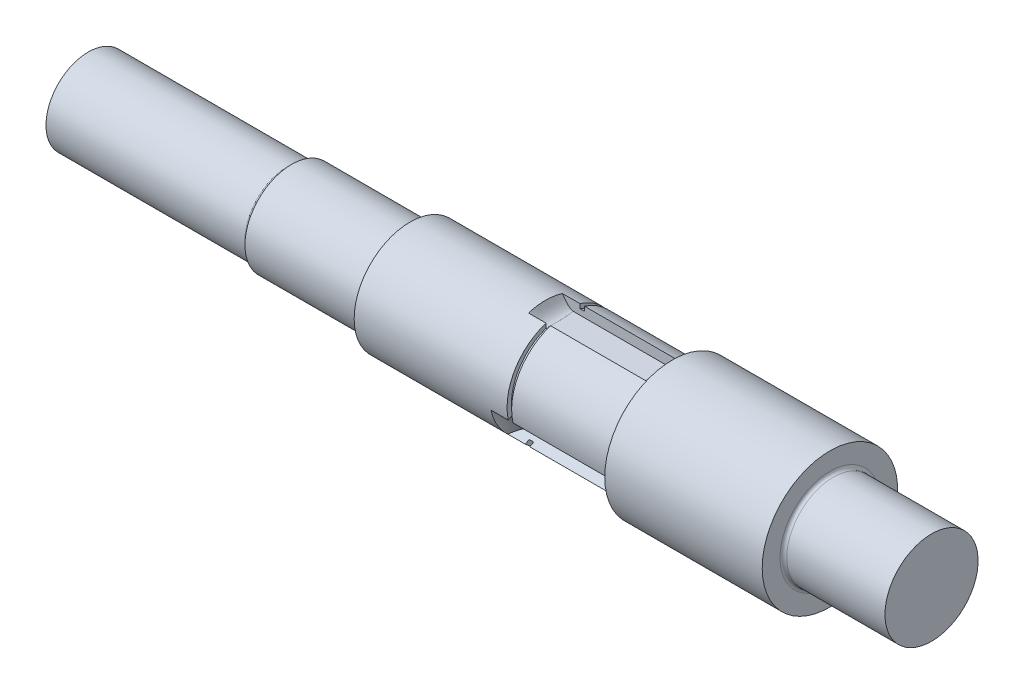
ISO-10303-21;
HEADER;
FILE_DESCRIPTION(('STEP AP214'),'2;1');
FILE_NAME('part.step','',(''),(''),'','','');
FILE_SCHEMA(('AUTOMOTIVE_DESIGN { 1 0 10303 214 1 1 1 1 }'));
ENDSEC;
DATA;
#1=APPLICATION_CONTEXT('core data for automotive mechanical design processes');
#2=APPLICATION_PROTOCOL_DEFINITION('international standard','automotive_design',2000,#1);
#3=PRODUCT_CONTEXT('',#1,'mechanical');
#4=PRODUCT('Part','Part','',(#3));
#5=PRODUCT_RELATED_PRODUCT_CATEGORY('part','',(#4));
#6=PRODUCT_DEFINITION_FORMATION('','',#4);
#7=PRODUCT_DEFINITION_CONTEXT('part definition',#1,'design');
#8=PRODUCT_DEFINITION('design','',#6,#7);
#9=PRODUCT_DEFINITION_SHAPE('','',#8);
#10=(LENGTH_UNIT() NAMED_UNIT(*) SI_UNIT(.MILLI.,.METRE.));
#11=(NAMED_UNIT(*) PLANE_ANGLE_UNIT() SI_UNIT($,.RADIAN.));
#12=(NAMED_UNIT(*) SI_UNIT($,.STERADIAN.) SOLID_ANGLE_UNIT());
#13=UNCERTAINTY_MEASURE_WITH_UNIT(LENGTH_MEASURE(1.E-05),#10,'distance_accuracy_value','');
#14=(GEOMETRIC_REPRESENTATION_CONTEXT(3) GLOBAL_UNCERTAINTY_ASSIGNED_CONTEXT((#13)) GLOBAL_UNIT_ASSIGNED_CONTEXT((#10,
#11,#12)) REPRESENTATION_CONTEXT('',''));
#15=CARTESIAN_POINT('',(0.,0.,0.));
#16=DIRECTION('',(0.,0.,1.));
#17=DIRECTION('',(1.,0.,0.));
#18=AXIS2_PLACEMENT_3D('',#15,#16,#17);
#19=CARTESIAN_POINT('',(0.,0.,0.));
#20=DIRECTION('',(-1.,0.,0.));
#21=DIRECTION('',(0.,0.,1.));
#22=AXIS2_PLACEMENT_3D('',#19,#20,#21);
#23=CYLINDRICAL_SURFACE('',#22,33.);
#24=DIRECTION('',(-1.,0.,0.));
#25=VECTOR('',#24,1.);
#26=CARTESIAN_POINT('',(0.,31.4483703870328,-10.));
#27=LINE('',#26,#25);
#28=CARTESIAN_POINT('',(220.,31.4483703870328,-10.));
#29=VERTEX_POINT('',#28);
#30=CARTESIAN_POINT('',(163.,31.4483703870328,-10.));
#31=VERTEX_POINT('',#30);
#32=EDGE_CURVE('E361',#29,#31,#27,.T.);
#33=ORIENTED_EDGE('',*,*,#32,.F.);
#34=CARTESIAN_POINT('',(220.,0.,0.));
#35=DIRECTION('',(1.,0.,0.));
#36=DIRECTION('',(0.,0.,-1.));
#37=AXIS2_PLACEMENT_3D('',#34,#35,#36);
#38=CIRCLE('',#37,33.);
#39=CARTESIAN_POINT('',(220.,-7.06393115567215,-32.2350876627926));
#40=VERTEX_POINT('',#39);
#41=EDGE_CURVE('E1095',#29,#40,#38,.F.);
#42=ORIENTED_EDGE('',*,*,#41,.T.);
#43=DIRECTION('',(-1.,0.,0.));
#44=VECTOR('',#43,1.);
#45=CARTESIAN_POINT('',(0.,-7.06393115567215,-32.2350876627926));
#46=LINE('',#45,#44);
#47=CARTESIAN_POINT('',(163.,-7.06393115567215,-32.2350876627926));
#48=VERTEX_POINT('',#47);
#49=EDGE_CURVE('E893',#48,#40,#46,.F.);
#50=ORIENTED_EDGE('',*,*,#49,.F.);
#51=CARTESIAN_POINT('',(163.,0.,0.));
#52=DIRECTION('',(-1.,0.,0.));
#53=DIRECTION('',(0.,0.,1.));
#54=AXIS2_PLACEMENT_3D('',#51,#52,#53);
#55=CIRCLE('',#54,33.);
#56=EDGE_CURVE('E283',#31,#48,#55,.T.);
#57=ORIENTED_EDGE('',*,*,#56,.F.);
#58=EDGE_LOOP('',(#33,#42,#50,#57));
#59=FACE_BOUND('',#58,.T.);
#60=ADVANCED_FACE('F51',(#59),#23,.T.);
#61=DIRECTION('',(-1.,0.,0.));
#62=VECTOR('',#61,1.);
#63=CARTESIAN_POINT('',(0.,-24.3844392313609,-22.2350876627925));
#64=LINE('',#63,#62);
#65=CARTESIAN_POINT('',(220.,-24.3844392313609,-22.2350876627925));
#66=VERTEX_POINT('',#65);
#67=CARTESIAN_POINT('',(163.,-24.3844392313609,-22.2350876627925));
#68=VERTEX_POINT('',#67);
#69=EDGE_CURVE('E373',#66,#68,#64,.T.);
#70=ORIENTED_EDGE('',*,*,#69,.F.);
#71=CARTESIAN_POINT('',(220.,0.,0.));
#72=DIRECTION('',(1.,0.,0.));
#73=DIRECTION('',(0.,0.,-1.));
#74=AXIS2_PLACEMENT_3D('',#71,#72,#73);
#75=CIRCLE('',#74,33.);
#76=CARTESIAN_POINT('',(220.,-24.3844392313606,22.2350876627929));
#77=VERTEX_POINT('',#76);
#78=EDGE_CURVE('E1100',#66,#77,#75,.F.);
#79=ORIENTED_EDGE('',*,*,#78,.T.);
#80=DIRECTION('',(-1.,0.,0.));
#81=VECTOR('',#80,1.);
#82=CARTESIAN_POINT('',(0.,-24.3844392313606,22.2350876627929));
#83=LINE('',#82,#81);
#84=CARTESIAN_POINT('',(163.,-24.3844392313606,22.2350876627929));
#85=VERTEX_POINT('',#84);
#86=EDGE_CURVE('E262',#85,#77,#83,.F.);
#87=ORIENTED_EDGE('',*,*,#86,.F.);
#88=EDGE_CURVE('E280',#68,#85,#55,.T.);
#89=ORIENTED_EDGE('',*,*,#88,.F.);
#90=EDGE_LOOP('',(#70,#79,#87,#89));
#91=FACE_BOUND('',#90,.T.);
#92=ADVANCED_FACE('F695',(#91),#23,.T.);
#93=CARTESIAN_POINT('',(0.,0.,0.));
#94=DIRECTION('',(-1.,0.,0.));
#95=DIRECTION('',(0.,0.,1.));
#96=AXIS2_PLACEMENT_3D('',#93,#94,#95);
#97=CYLINDRICAL_SURFACE('',#96,33.);
#98=CARTESIAN_POINT('',(70.,0.,0.));
#99=DIRECTION('',(-1.,0.,0.));
#100=DIRECTION('',(0.,0.,1.));
#101=AXIS2_PLACEMENT_3D('',#98,#99,#100);
#102=CIRCLE('',#101,33.);
#103=CARTESIAN_POINT('',(70.,0.,33.));
#104=VERTEX_POINT('',#103);
#105=EDGE_CURVE('E344',#104,#104,#102,.T.);
#106=ORIENTED_EDGE('',*,*,#105,.F.);
#107=EDGE_LOOP('',(#106));
#108=FACE_BOUND('',#107,.T.);
#109=DIRECTION('',(-1.,0.,0.));
#110=VECTOR('',#109,1.);
#111=CARTESIAN_POINT('',(0.,-7.06393115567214,-32.2350876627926));
#112=LINE('',#111,#110);
#113=CARTESIAN_POINT('',(149.999996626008,-7.06389360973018,-32.2350226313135));
#114=VERTEX_POINT('',#113);
#115=CARTESIAN_POINT('',(160.33,-7.06393115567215,-32.2350876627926));
#116=VERTEX_POINT('',#115);
#117=EDGE_CURVE('E979',#114,#116,#112,.F.);
#118=ORIENTED_EDGE('',*,*,#117,.F.);
#119=CARTESIAN_POINT('',(150.,-25.010468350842,-21.5285037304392));
#120=CARTESIAN_POINT('',(150.,-23.8929140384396,-22.8268083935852));
#121=CARTESIAN_POINT('',(150.,-22.6083677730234,-24.1111229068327));
#122=CARTESIAN_POINT('',(150.,-19.7450859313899,-26.5069070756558));
#123=CARTESIAN_POINT('',(150.,-18.1660493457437,-27.6169442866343));
#124=CARTESIAN_POINT('',(150.,-14.8339506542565,-29.5407323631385));
#125=CARTESIAN_POINT('',(150.,-13.0831119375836,-30.3531995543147));
#126=CARTESIAN_POINT('',(150.,-9.57666106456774,-31.6349822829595));
#127=CARTESIAN_POINT('',(150.,-7.82213893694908,-32.1052747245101));
#128=CARTESIAN_POINT('',(150.,-6.13899696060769,-32.4239528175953));
#129=(BOUNDED_CURVE() B_SPLINE_CURVE(3,(#119,#120,#121,#122,#123,#124,#125,#126,#127,#128),
.UNSPECIFIED.,.F.,.F.) B_SPLINE_CURVE_WITH_KNOTS((4,2,2,2,4),(-0.00241717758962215,
0.00379141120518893,0.01,0.0162085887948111,0.0224171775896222),
.UNSPECIFIED.) CURVE() GEOMETRIC_REPRESENTATION_ITEM() RATIONAL_B_SPLINE_CURVE((1.,1.,1.,1.,1.,
1.,1.,1.,1.,1.)) REPRESENTATION_ITEM(''));
#130=CARTESIAN_POINT('',(149.999993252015,-24.3843641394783,-22.2349575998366));
#131=VERTEX_POINT('',#130);
#132=EDGE_CURVE('E877',#131,#114,#129,.T.);
#133=ORIENTED_EDGE('',*,*,#132,.F.);
#134=DIRECTION('',(-1.,0.,0.));
#135=VECTOR('',#134,1.);
#136=CARTESIAN_POINT('',(0.,-24.3844392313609,-22.2350876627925));
#137=LINE('',#136,#135);
#138=CARTESIAN_POINT('',(160.33,-24.3844392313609,-22.2350876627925));
#139=VERTEX_POINT('',#138);
#140=EDGE_CURVE('E819',#139,#131,#137,.T.);
#141=ORIENTED_EDGE('',*,*,#140,.F.);
#142=CARTESIAN_POINT('',(160.33,0.,0.));
#143=DIRECTION('',(-1.,0.,0.));
#144=DIRECTION('',(0.,0.,1.));
#145=AXIS2_PLACEMENT_3D('',#142,#143,#144);
#146=CIRCLE('',#145,33.);
#147=CARTESIAN_POINT('',(160.33,-24.3844392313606,22.2350876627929));
#148=VERTEX_POINT('',#147);
#149=EDGE_CURVE('E332',#139,#148,#146,.T.);
#150=ORIENTED_EDGE('',*,*,#149,.T.);
#151=DIRECTION('',(-1.,0.,0.));
#152=VECTOR('',#151,1.);
#153=CARTESIAN_POINT('',(0.,-24.3844392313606,22.2350876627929));
#154=LINE('',#153,#152);
#155=CARTESIAN_POINT('',(149.999996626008,-24.3844016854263,22.2350226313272));
#156=VERTEX_POINT('',#155);
#157=EDGE_CURVE('E404',#156,#148,#154,.F.);
#158=ORIENTED_EDGE('',*,*,#157,.F.);
#159=CARTESIAN_POINT('',(150.,-6.13899696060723,32.4239528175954));
#160=CARTESIAN_POINT('',(150.,-7.82213893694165,32.1052747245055));
#161=CARTESIAN_POINT('',(150.,-9.576661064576,31.6349822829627));
#162=CARTESIAN_POINT('',(150.,-13.0831119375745,30.3531995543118));
#163=CARTESIAN_POINT('',(150.,-14.8339506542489,29.5407323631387));
#164=CARTESIAN_POINT('',(150.,-18.1660493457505,27.6169442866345));
#165=CARTESIAN_POINT('',(150.,-19.7450859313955,26.5069070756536));
#166=CARTESIAN_POINT('',(150.,-22.6083677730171,24.1111229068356));
#167=CARTESIAN_POINT('',(150.,-23.8929140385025,22.8268083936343));
#168=CARTESIAN_POINT('',(150.,-25.0104683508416,21.5285037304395));
#169=(BOUNDED_CURVE() B_SPLINE_CURVE(3,(#159,#160,#161,#162,#163,#164,#165,#166,#167,#168),
.UNSPECIFIED.,.F.,.F.) B_SPLINE_CURVE_WITH_KNOTS((4,2,2,2,4),(-0.00241717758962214,
0.00379141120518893,0.01,0.0162085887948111,0.0224171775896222),
.UNSPECIFIED.) CURVE() GEOMETRIC_REPRESENTATION_ITEM() RATIONAL_B_SPLINE_CURVE((1.,1.,1.,1.,1.,
1.,1.,1.,1.,1.)) REPRESENTATION_ITEM(''));
#170=CARTESIAN_POINT('',(149.999993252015,-7.06385606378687,32.2349575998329));
#171=VERTEX_POINT('',#170);
#172=EDGE_CURVE('E888',#171,#156,#169,.T.);
#173=ORIENTED_EDGE('',*,*,#172,.F.);
#174=DIRECTION('',(-1.,0.,0.));
#175=VECTOR('',#174,1.);
#176=CARTESIAN_POINT('',(0.,-7.0639311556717,32.2350876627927));
#177=LINE('',#176,#175);
#178=CARTESIAN_POINT('',(160.33,-7.0639311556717,32.2350876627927));
#179=VERTEX_POINT('',#178);
#180=EDGE_CURVE('E1237',#179,#171,#177,.T.);
#181=ORIENTED_EDGE('',*,*,#180,.F.);
#182=CARTESIAN_POINT('',(160.33,31.4483703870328,10.));
#183=VERTEX_POINT('',#182);
#184=EDGE_CURVE('E326',#179,#183,#146,.T.);
#185=ORIENTED_EDGE('',*,*,#184,.T.);
#186=DIRECTION('',(-1.,0.,0.));
#187=VECTOR('',#186,1.);
#188=CARTESIAN_POINT('',(0.,31.4483703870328,9.99999999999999));
#189=LINE('',#188,#187);
#190=CARTESIAN_POINT('',(149.999996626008,31.4482952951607,10.));
#191=VERTEX_POINT('',#190);
#192=EDGE_CURVE('E1022',#191,#183,#189,.F.);
#193=ORIENTED_EDGE('',*,*,#192,.F.);
#194=CARTESIAN_POINT('',(150.,31.1494653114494,-10.8954490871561));
#195=CARTESIAN_POINT('',(150.,31.7150529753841,-9.27846633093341));
#196=CARTESIAN_POINT('',(150.,32.1850288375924,-7.52385937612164));
#197=CARTESIAN_POINT('',(150.,32.8281978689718,-3.84629247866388));
#198=CARTESIAN_POINT('',(150.,33.,-1.92378807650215));
#199=CARTESIAN_POINT('',(150.,33.,1.92378807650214));
#200=CARTESIAN_POINT('',(150.,32.828197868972,3.84629247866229));
#201=CARTESIAN_POINT('',(150.,32.1850288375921,7.52385937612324));
#202=CARTESIAN_POINT('',(150.,31.7150529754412,9.27846633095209));
#203=CARTESIAN_POINT('',(150.,31.1494653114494,10.8954490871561));
#204=(BOUNDED_CURVE() B_SPLINE_CURVE(3,(#194,#195,#196,#197,#198,#199,#200,#201,#202,#203),
.UNSPECIFIED.,.F.,.F.) B_SPLINE_CURVE_WITH_KNOTS((4,2,2,2,4),(-0.00241717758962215,
0.00379141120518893,0.01,0.0162085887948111,0.0224171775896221),
.UNSPECIFIED.) CURVE() GEOMETRIC_REPRESENTATION_ITEM() RATIONAL_B_SPLINE_CURVE((1.,1.,1.,1.,1.,
1.,1.,1.,1.,1.)) REPRESENTATION_ITEM(''));
#205=CARTESIAN_POINT('',(149.999993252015,31.448220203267,-10.));
#206=VERTEX_POINT('',#205);
#207=EDGE_CURVE('E671',#206,#191,#204,.T.);
#208=ORIENTED_EDGE('',*,*,#207,.F.);
#209=DIRECTION('',(-1.,0.,0.));
#210=VECTOR('',#209,1.);
#211=CARTESIAN_POINT('',(0.,31.4483703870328,-10.));
#212=LINE('',#211,#210);
#213=CARTESIAN_POINT('',(160.33,31.4483703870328,-10.));
#214=VERTEX_POINT('',#213);
#215=EDGE_CURVE('E613',#214,#206,#212,.T.);
#216=ORIENTED_EDGE('',*,*,#215,.F.);
#217=EDGE_CURVE('E333',#214,#116,#146,.T.);
#218=ORIENTED_EDGE('',*,*,#217,.T.);
#219=EDGE_LOOP('',(#118,#133,#141,#150,#158,#173,#181,#185,#193,#208,#216,#218));
#220=FACE_BOUND('',#219,.T.);
#221=ADVANCED_FACE('F684',(#108,#220),#97,.T.);
#222=CARTESIAN_POINT('',(160.33,33.,0.));
#223=DIRECTION('',(-1.,0.,0.));
#224=DIRECTION('',(0.,0.,1.));
#225=AXIS2_PLACEMENT_3D('',#222,#223,#224);
#226=PLANE('',#225);
#227=DIRECTION('',(0.,0.500000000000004,0.866025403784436));
#228=VECTOR('',#227,1.);
#229=CARTESIAN_POINT('',(160.33,16.9102540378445,9.28941916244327));
#230=LINE('',#229,#228);
#231=CARTESIAN_POINT('',(160.33,-5.74677549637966,-29.9537071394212));
#232=VERTEX_POINT('',#231);
#233=EDGE_CURVE('E976',#116,#232,#230,.T.);
#234=ORIENTED_EDGE('',*,*,#233,.F.);
#235=ORIENTED_EDGE('',*,*,#217,.F.);
#236=DIRECTION('',(0.,1.,0.));
#237=VECTOR('',#236,1.);
#238=CARTESIAN_POINT('',(160.33,33.,-10.));
#239=LINE('',#238,#237);
#240=CARTESIAN_POINT('',(160.33,28.8140590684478,-10.));
#241=VERTEX_POINT('',#240);
#242=EDGE_CURVE('E623',#241,#214,#239,.T.);
#243=ORIENTED_EDGE('',*,*,#242,.F.);
#244=CARTESIAN_POINT('',(160.33,0.,0.));
#245=DIRECTION('',(-1.,0.,0.));
#246=DIRECTION('',(0.,0.,1.));
#247=AXIS2_PLACEMENT_3D('',#244,#245,#246);
#248=CIRCLE('',#247,30.5);
#249=EDGE_CURVE('E315',#241,#232,#248,.T.);
#250=ORIENTED_EDGE('',*,*,#249,.T.);
#251=EDGE_LOOP('',(#234,#235,#243,#250));
#252=FACE_BOUND('',#251,.T.);
#253=ADVANCED_FACE('F694',(#252),#226,.F.);
#254=DIRECTION('',(0.,-0.500000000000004,-0.866025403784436));
#255=VECTOR('',#254,1.);
#256=CARTESIAN_POINT('',(160.33,-0.41025403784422,19.2894191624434));
#257=LINE('',#256,#255);
#258=CARTESIAN_POINT('',(160.33,-23.0672835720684,-19.9537071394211));
#259=VERTEX_POINT('',#258);
#260=EDGE_CURVE('E829',#259,#139,#257,.T.);
#261=ORIENTED_EDGE('',*,*,#260,.F.);
#262=CARTESIAN_POINT('',(160.33,-23.0672835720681,19.9537071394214));
#263=VERTEX_POINT('',#262);
#264=EDGE_CURVE('E314',#259,#263,#248,.T.);
#265=ORIENTED_EDGE('',*,*,#264,.T.);
#266=DIRECTION('',(0.,0.499999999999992,-0.866025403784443));
#267=VECTOR('',#266,1.);
#268=CARTESIAN_POINT('',(160.33,-0.410254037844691,-19.289419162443));
#269=LINE('',#268,#267);
#270=EDGE_CURVE('E954',#148,#263,#269,.T.);
#271=ORIENTED_EDGE('',*,*,#270,.F.);
#272=ORIENTED_EDGE('',*,*,#149,.F.);
#273=EDGE_LOOP('',(#261,#265,#271,#272));
#274=FACE_BOUND('',#273,.T.);
#275=ADVANCED_FACE('F1280',(#274),#226,.F.);
#276=DIRECTION('',(0.,-0.499999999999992,0.866025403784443));
#277=VECTOR('',#276,1.);
#278=CARTESIAN_POINT('',(160.33,16.9102540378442,-9.28941916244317));
#279=LINE('',#278,#277);
#280=CARTESIAN_POINT('',(160.33,-5.74677549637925,29.9537071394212));
#281=VERTEX_POINT('',#280);
#282=EDGE_CURVE('E1240',#281,#179,#279,.T.);
#283=ORIENTED_EDGE('',*,*,#282,.F.);
#284=CARTESIAN_POINT('',(160.33,28.8140590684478,9.99999999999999));
#285=VERTEX_POINT('',#284);
#286=EDGE_CURVE('E308',#281,#285,#248,.T.);
#287=ORIENTED_EDGE('',*,*,#286,.T.);
#288=DIRECTION('',(0.,-1.,0.));
#289=VECTOR('',#288,1.);
#290=CARTESIAN_POINT('',(160.33,33.,10.));
#291=LINE('',#290,#289);
#292=EDGE_CURVE('E1025',#183,#285,#291,.T.);
#293=ORIENTED_EDGE('',*,*,#292,.F.);
#294=ORIENTED_EDGE('',*,*,#184,.F.);
#295=EDGE_LOOP('',(#283,#287,#293,#294));
#296=FACE_BOUND('',#295,.T.);
#297=ADVANCED_FACE('F1282',(#296),#226,.F.);
#298=CARTESIAN_POINT('',(0.,0.,0.));
#299=DIRECTION('',(-1.,0.,0.));
#300=DIRECTION('',(0.,0.,1.));
#301=AXIS2_PLACEMENT_3D('',#298,#299,#300);
#302=CYLINDRICAL_SURFACE('',#301,30.5);
#303=DIRECTION('',(-1.,0.,0.));
#304=VECTOR('',#303,1.);
#305=CARTESIAN_POINT('',(0.,-5.74677549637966,-29.9537071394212));
#306=LINE('',#305,#304);
#307=CARTESIAN_POINT('',(163.,-5.74677549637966,-29.9537071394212));
#308=VERTEX_POINT('',#307);
#309=EDGE_CURVE('E973',#232,#308,#306,.F.);
#310=ORIENTED_EDGE('',*,*,#309,.F.);
#311=ORIENTED_EDGE('',*,*,#249,.F.);
#312=DIRECTION('',(-1.,0.,0.));
#313=VECTOR('',#312,1.);
#314=CARTESIAN_POINT('',(0.,28.8140590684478,-10.));
#315=LINE('',#314,#313);
#316=CARTESIAN_POINT('',(163.,28.8140590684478,-10.));
#317=VERTEX_POINT('',#316);
#318=EDGE_CURVE('E1289',#317,#241,#315,.T.);
#319=ORIENTED_EDGE('',*,*,#318,.F.);
#320=CARTESIAN_POINT('',(163.,0.,0.));
#321=DIRECTION('',(-1.,0.,0.));
#322=DIRECTION('',(0.,0.,1.));
#323=AXIS2_PLACEMENT_3D('',#320,#321,#322);
#324=CIRCLE('',#323,30.5);
#325=EDGE_CURVE('E299',#317,#308,#324,.T.);
#326=ORIENTED_EDGE('',*,*,#325,.T.);
#327=EDGE_LOOP('',(#310,#311,#319,#326));
#328=FACE_BOUND('',#327,.T.);
#329=ADVANCED_FACE('F1091',(#328),#302,.T.);
#330=DIRECTION('',(-1.,0.,0.));
#331=VECTOR('',#330,1.);
#332=CARTESIAN_POINT('',(0.,-23.0672835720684,-19.9537071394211));
#333=LINE('',#332,#331);
#334=CARTESIAN_POINT('',(163.,-23.0672835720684,-19.9537071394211));
#335=VERTEX_POINT('',#334);
#336=EDGE_CURVE('E957',#335,#259,#333,.T.);
#337=ORIENTED_EDGE('',*,*,#336,.F.);
#338=CARTESIAN_POINT('',(163.,-23.0672835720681,19.9537071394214));
#339=VERTEX_POINT('',#338);
#340=EDGE_CURVE('E298',#335,#339,#324,.T.);
#341=ORIENTED_EDGE('',*,*,#340,.T.);
#342=DIRECTION('',(-1.,0.,0.));
#343=VECTOR('',#342,1.);
#344=CARTESIAN_POINT('',(0.,-23.0672835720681,19.9537071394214));
#345=LINE('',#344,#343);
#346=EDGE_CURVE('E959',#263,#339,#345,.F.);
#347=ORIENTED_EDGE('',*,*,#346,.F.);
#348=ORIENTED_EDGE('',*,*,#264,.F.);
#349=EDGE_LOOP('',(#337,#341,#347,#348));
#350=FACE_BOUND('',#349,.T.);
#351=ADVANCED_FACE('F1090',(#350),#302,.T.);
#352=DIRECTION('',(-1.,0.,0.));
#353=VECTOR('',#352,1.);
#354=CARTESIAN_POINT('',(0.,-5.74677549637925,29.9537071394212));
#355=LINE('',#354,#353);
#356=CARTESIAN_POINT('',(163.,-5.74677549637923,29.9537071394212));
#357=VERTEX_POINT('',#356);
#358=EDGE_CURVE('E273',#357,#281,#355,.T.);
#359=ORIENTED_EDGE('',*,*,#358,.F.);
#360=CARTESIAN_POINT('',(163.,28.8140590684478,10.));
#361=VERTEX_POINT('',#360);
#362=EDGE_CURVE('E271',#357,#361,#324,.T.);
#363=ORIENTED_EDGE('',*,*,#362,.T.);
#364=DIRECTION('',(-1.,0.,0.));
#365=VECTOR('',#364,1.);
#366=CARTESIAN_POINT('',(0.,28.8140590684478,9.99999999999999));
#367=LINE('',#366,#365);
#368=EDGE_CURVE('E1030',#285,#361,#367,.F.);
#369=ORIENTED_EDGE('',*,*,#368,.F.);
#370=ORIENTED_EDGE('',*,*,#286,.F.);
#371=EDGE_LOOP('',(#359,#363,#369,#370));
#372=FACE_BOUND('',#371,.T.);
#373=ADVANCED_FACE('F1086',(#372),#302,.T.);
#374=CARTESIAN_POINT('',(163.,30.5,0.));
#375=DIRECTION('',(1.,0.,0.));
#376=DIRECTION('',(0.,0.,-1.));
#377=AXIS2_PLACEMENT_3D('',#374,#375,#376);
#378=PLANE('',#377);
#379=DIRECTION('',(0.,-0.500000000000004,-0.866025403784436));
#380=VECTOR('',#379,1.);
#381=CARTESIAN_POINT('',(163.,16.2852540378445,8.20688740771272));
#382=LINE('',#381,#380);
#383=EDGE_CURVE('E828',#308,#48,#382,.T.);
#384=ORIENTED_EDGE('',*,*,#383,.F.);
#385=ORIENTED_EDGE('',*,*,#325,.F.);
#386=DIRECTION('',(0.,-1.,0.));
#387=VECTOR('',#386,1.);
#388=CARTESIAN_POINT('',(163.,30.5,-10.));
#389=LINE('',#388,#387);
#390=EDGE_CURVE('E1291',#31,#317,#389,.T.);
#391=ORIENTED_EDGE('',*,*,#390,.F.);
#392=ORIENTED_EDGE('',*,*,#56,.T.);
#393=EDGE_LOOP('',(#384,#385,#391,#392));
#394=FACE_BOUND('',#393,.T.);
#395=ADVANCED_FACE('F1079',(#394),#378,.F.);
#396=DIRECTION('',(0.,0.500000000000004,0.866025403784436));
#397=VECTOR('',#396,1.);
#398=CARTESIAN_POINT('',(163.,-1.03525403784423,18.2068874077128));
#399=LINE('',#398,#397);
#400=EDGE_CURVE('E953',#68,#335,#399,.T.);
#401=ORIENTED_EDGE('',*,*,#400,.F.);
#402=ORIENTED_EDGE('',*,*,#88,.T.);
#403=DIRECTION('',(0.,-0.499999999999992,0.866025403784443));
#404=VECTOR('',#403,1.);
#405=CARTESIAN_POINT('',(163.,-1.03525403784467,-18.2068874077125));
#406=LINE('',#405,#404);
#407=EDGE_CURVE('E963',#339,#85,#406,.T.);
#408=ORIENTED_EDGE('',*,*,#407,.F.);
#409=ORIENTED_EDGE('',*,*,#340,.F.);
#410=EDGE_LOOP('',(#401,#402,#408,#409));
#411=FACE_BOUND('',#410,.T.);
#412=ADVANCED_FACE('F1078',(#411),#378,.F.);
#413=DIRECTION('',(0.,0.499999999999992,-0.866025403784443));
#414=VECTOR('',#413,1.);
#415=CARTESIAN_POINT('',(163.,16.2852540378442,-8.20688740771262));
#416=LINE('',#415,#414);
#417=CARTESIAN_POINT('',(163.,-7.0639311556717,32.2350876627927));
#418=VERTEX_POINT('',#417);
#419=EDGE_CURVE('E253',#418,#357,#416,.T.);
#420=ORIENTED_EDGE('',*,*,#419,.F.);
#421=CARTESIAN_POINT('',(163.,31.4483703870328,9.99999999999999));
#422=VERTEX_POINT('',#421);
#423=EDGE_CURVE('E269',#418,#422,#55,.T.);
#424=ORIENTED_EDGE('',*,*,#423,.T.);
#425=DIRECTION('',(0.,1.,0.));
#426=VECTOR('',#425,1.);
#427=CARTESIAN_POINT('',(163.,30.5,10.));
#428=LINE('',#427,#426);
#429=EDGE_CURVE('E622',#361,#422,#428,.T.);
#430=ORIENTED_EDGE('',*,*,#429,.F.);
#431=ORIENTED_EDGE('',*,*,#362,.F.);
#432=EDGE_LOOP('',(#420,#424,#430,#431));
#433=FACE_BOUND('',#432,.T.);
#434=ADVANCED_FACE('F267',(#433),#378,.F.);
#435=DIRECTION('',(-1.,0.,0.));
#436=VECTOR('',#435,1.);
#437=CARTESIAN_POINT('',(0.,-7.0639311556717,32.2350876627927));
#438=LINE('',#437,#436);
#439=CARTESIAN_POINT('',(220.,-7.0639311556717,32.2350876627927));
#440=VERTEX_POINT('',#439);
#441=EDGE_CURVE('E249',#440,#418,#438,.T.);
#442=ORIENTED_EDGE('',*,*,#441,.F.);
#443=CARTESIAN_POINT('',(220.,0.,0.));
#444=DIRECTION('',(1.,0.,0.));
#445=DIRECTION('',(0.,0.,-1.));
#446=AXIS2_PLACEMENT_3D('',#443,#444,#445);
#447=CIRCLE('',#446,33.);
#448=CARTESIAN_POINT('',(220.,31.4483703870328,9.99999999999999));
#449=VERTEX_POINT('',#448);
#450=EDGE_CURVE('E1105',#440,#449,#447,.F.);
#451=ORIENTED_EDGE('',*,*,#450,.T.);
#452=DIRECTION('',(-1.,0.,0.));
#453=VECTOR('',#452,1.);
#454=CARTESIAN_POINT('',(0.,31.4483703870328,9.99999999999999));
#455=LINE('',#454,#453);
#456=EDGE_CURVE('E278',#422,#449,#455,.F.);
#457=ORIENTED_EDGE('',*,*,#456,.F.);
#458=ORIENTED_EDGE('',*,*,#423,.F.);
#459=EDGE_LOOP('',(#442,#451,#457,#458));
#460=FACE_BOUND('',#459,.T.);
#461=ADVANCED_FACE('F277',(#460),#23,.T.);
#462=CARTESIAN_POINT('',(-120.,0.,0.));
#463=DIRECTION('',(1.,0.,0.));
#464=DIRECTION('',(0.,0.,-1.));
#465=AXIS2_PLACEMENT_3D('',#462,#463,#464);
#466=PLANE('',#465);
#467=CARTESIAN_POINT('',(-120.,0.,0.));
#468=DIRECTION('',(-1.,0.,0.));
#469=DIRECTION('',(0.,0.,1.));
#470=AXIS2_PLACEMENT_3D('',#467,#468,#469);
#471=CIRCLE('',#470,25.);
#472=CARTESIAN_POINT('',(-120.,0.,25.));
#473=VERTEX_POINT('',#472);
#474=EDGE_CURVE('E355',#473,#473,#471,.T.);
#475=ORIENTED_EDGE('',*,*,#474,.T.);
#476=EDGE_LOOP('',(#475));
#477=FACE_BOUND('',#476,.T.);
#478=ADVANCED_FACE('F1070',(#477),#466,.F.);
#479=CARTESIAN_POINT('',(0.,0.,0.));
#480=DIRECTION('',(-1.,0.,0.));
#481=DIRECTION('',(0.,0.,1.));
#482=AXIS2_PLACEMENT_3D('',#479,#480,#481);
#483=CYLINDRICAL_SURFACE('',#482,25.);
#484=CARTESIAN_POINT('',(-2.5,0.,0.));
#485=DIRECTION('',(1.,0.,0.));
#486=DIRECTION('',(0.,0.,-1.));
#487=AXIS2_PLACEMENT_3D('',#484,#485,#486);
#488=CIRCLE('',#487,25.);
#489=CARTESIAN_POINT('',(-2.5,0.,-25.));
#490=VERTEX_POINT('',#489);
#491=EDGE_CURVE('E12',#490,#490,#488,.F.);
#492=ORIENTED_EDGE('',*,*,#491,.T.);
#493=EDGE_LOOP('',(#492));
#494=FACE_BOUND('',#493,.T.);
#495=ORIENTED_EDGE('',*,*,#474,.F.);
#496=EDGE_LOOP('',(#495));
#497=FACE_BOUND('',#496,.T.);
#498=ADVANCED_FACE('F1075',(#494,#497),#483,.T.);
#499=CARTESIAN_POINT('',(0.,0.,0.));
#500=DIRECTION('',(-1.,0.,0.));
#501=DIRECTION('',(0.,0.,1.));
#502=AXIS2_PLACEMENT_3D('',#499,#500,#501);
#503=CYLINDRICAL_SURFACE('',#502,27.5);
#504=CARTESIAN_POINT('',(68.,0.,0.));
#505=DIRECTION('',(1.,0.,0.));
#506=DIRECTION('',(0.,0.,-1.));
#507=AXIS2_PLACEMENT_3D('',#504,#505,#506);
#508=CIRCLE('',#507,27.5);
#509=CARTESIAN_POINT('',(68.,0.,-27.5));
#510=VERTEX_POINT('',#509);
#511=EDGE_CURVE('E1117',#510,#510,#508,.F.);
#512=ORIENTED_EDGE('',*,*,#511,.T.);
#513=EDGE_LOOP('',(#512));
#514=FACE_BOUND('',#513,.T.);
#515=CARTESIAN_POINT('',(0.,0.,0.));
#516=DIRECTION('',(-1.,0.,0.));
#517=DIRECTION('',(0.,0.,1.));
#518=AXIS2_PLACEMENT_3D('',#515,#516,#517);
#519=CIRCLE('',#518,27.5);
#520=CARTESIAN_POINT('',(0.,0.,27.5));
#521=VERTEX_POINT('',#520);
#522=EDGE_CURVE('E350',#521,#521,#519,.T.);
#523=ORIENTED_EDGE('',*,*,#522,.F.);
#524=EDGE_LOOP('',(#523));
#525=FACE_BOUND('',#524,.T.);
#526=ADVANCED_FACE('F1415',(#514,#525),#503,.T.);
#527=CARTESIAN_POINT('',(70.,33.,0.));
#528=DIRECTION('',(1.,0.,0.));
#529=DIRECTION('',(0.,0.,-1.));
#530=AXIS2_PLACEMENT_3D('',#527,#528,#529);
#531=PLANE('',#530);
#532=CARTESIAN_POINT('',(70.,0.,0.));
#533=DIRECTION('',(1.,0.,0.));
#534=DIRECTION('',(0.,0.,-1.));
#535=AXIS2_PLACEMENT_3D('',#532,#533,#534);
#536=CIRCLE('',#535,29.5);
#537=CARTESIAN_POINT('',(70.,0.,-29.5));
#538=VERTEX_POINT('',#537);
#539=EDGE_CURVE('E1113',#538,#538,#536,.T.);
#540=ORIENTED_EDGE('',*,*,#539,.T.);
#541=EDGE_LOOP('',(#540));
#542=FACE_BOUND('',#541,.T.);
#543=ORIENTED_EDGE('',*,*,#105,.T.);
#544=EDGE_LOOP('',(#543));
#545=FACE_BOUND('',#544,.T.);
#546=ADVANCED_FACE('F698',(#542,#545),#531,.F.);
#547=CARTESIAN_POINT('',(225.,40.,0.));
#548=DIRECTION('',(1.,0.,0.));
#549=DIRECTION('',(0.,0.,-1.));
#550=AXIS2_PLACEMENT_3D('',#547,#548,#549);
#551=PLANE('',#550);
#552=CARTESIAN_POINT('',(225.,0.,0.));
#553=DIRECTION('',(1.,0.,0.));
#554=DIRECTION('',(0.,0.,-1.));
#555=AXIS2_PLACEMENT_3D('',#552,#553,#554);
#556=CIRCLE('',#555,38.);
#557=CARTESIAN_POINT('',(225.,0.,-38.));
#558=VERTEX_POINT('',#557);
#559=EDGE_CURVE('E1099',#558,#558,#556,.T.);
#560=ORIENTED_EDGE('',*,*,#559,.T.);
#561=EDGE_LOOP('',(#560));
#562=FACE_BOUND('',#561,.T.);
#563=CARTESIAN_POINT('',(225.,0.,0.));
#564=DIRECTION('',(-1.,0.,0.));
#565=DIRECTION('',(0.,0.,1.));
#566=AXIS2_PLACEMENT_3D('',#563,#564,#565);
#567=CIRCLE('',#566,40.);
#568=CARTESIAN_POINT('',(225.,0.,40.));
#569=VERTEX_POINT('',#568);
#570=EDGE_CURVE('E281',#569,#569,#567,.T.);
#571=ORIENTED_EDGE('',*,*,#570,.T.);
#572=EDGE_LOOP('',(#571));
#573=FACE_BOUND('',#572,.T.);
#574=ADVANCED_FACE('F1054',(#562,#573),#551,.F.);
#575=CARTESIAN_POINT('',(0.,0.,0.));
#576=DIRECTION('',(-1.,0.,0.));
#577=DIRECTION('',(0.,0.,1.));
#578=AXIS2_PLACEMENT_3D('',#575,#576,#577);
#579=CYLINDRICAL_SURFACE('',#578,40.);
#580=ORIENTED_EDGE('',*,*,#570,.F.);
#581=EDGE_LOOP('',(#580));
#582=FACE_BOUND('',#581,.T.);
#583=CARTESIAN_POINT('',(318.,0.,0.));
#584=DIRECTION('',(-1.,0.,0.));
#585=DIRECTION('',(0.,0.,1.));
#586=AXIS2_PLACEMENT_3D('',#583,#584,#585);
#587=CIRCLE('',#586,40.);
#588=CARTESIAN_POINT('',(318.,0.,40.));
#589=VERTEX_POINT('',#588);
#590=EDGE_CURVE('E288',#589,#589,#587,.T.);
#591=ORIENTED_EDGE('',*,*,#590,.T.);
#592=EDGE_LOOP('',(#591));
#593=FACE_BOUND('',#592,.T.);
#594=ADVANCED_FACE('F1041',(#582,#593),#579,.T.);
#595=CARTESIAN_POINT('',(318.,27.5,0.));
#596=DIRECTION('',(-1.,0.,0.));
#597=DIRECTION('',(0.,0.,1.));
#598=AXIS2_PLACEMENT_3D('',#595,#596,#597);
#599=PLANE('',#598);
#600=CARTESIAN_POINT('',(318.,0.,0.));
#601=DIRECTION('',(-1.,0.,0.));
#602=DIRECTION('',(0.,0.,1.));
#603=AXIS2_PLACEMENT_3D('',#600,#601,#602);
#604=CIRCLE('',#603,29.5);
#605=CARTESIAN_POINT('',(318.,0.,29.5));
#606=VERTEX_POINT('',#605);
#607=EDGE_CURVE('E1110',#606,#606,#604,.T.);
#608=ORIENTED_EDGE('',*,*,#607,.T.);
#609=EDGE_LOOP('',(#608));
#610=FACE_BOUND('',#609,.T.);
#611=ORIENTED_EDGE('',*,*,#590,.F.);
#612=EDGE_LOOP('',(#611));
#613=FACE_BOUND('',#612,.T.);
#614=ADVANCED_FACE('F1043',(#610,#613),#599,.F.);
#615=CARTESIAN_POINT('',(0.,0.,0.));
#616=DIRECTION('',(-1.,0.,0.));
#617=DIRECTION('',(0.,0.,1.));
#618=AXIS2_PLACEMENT_3D('',#615,#616,#617);
#619=CYLINDRICAL_SURFACE('',#618,27.5);
#620=CARTESIAN_POINT('',(320.,0.,0.));
#621=DIRECTION('',(-1.,0.,0.));
#622=DIRECTION('',(0.,0.,1.));
#623=AXIS2_PLACEMENT_3D('',#620,#621,#622);
#624=CIRCLE('',#623,27.5);
#625=CARTESIAN_POINT('',(320.,0.,27.5));
#626=VERTEX_POINT('',#625);
#627=EDGE_CURVE('E369',#626,#626,#624,.F.);
#628=ORIENTED_EDGE('',*,*,#627,.T.);
#629=EDGE_LOOP('',(#628));
#630=FACE_BOUND('',#629,.T.);
#631=CARTESIAN_POINT('',(378.,0.,0.));
#632=DIRECTION('',(-1.,0.,0.));
#633=DIRECTION('',(0.,0.,1.));
#634=AXIS2_PLACEMENT_3D('',#631,#632,#633);
#635=CIRCLE('',#634,27.5);
#636=CARTESIAN_POINT('',(378.,0.,27.5));
#637=VERTEX_POINT('',#636);
#638=EDGE_CURVE('E1024',#637,#637,#635,.T.);
#639=ORIENTED_EDGE('',*,*,#638,.T.);
#640=EDGE_LOOP('',(#639));
#641=FACE_BOUND('',#640,.T.);
#642=ADVANCED_FACE('F1045',(#630,#641),#619,.T.);
#643=CARTESIAN_POINT('',(378.,0.,0.));
#644=DIRECTION('',(-1.,0.,0.));
#645=DIRECTION('',(0.,0.,1.));
#646=AXIS2_PLACEMENT_3D('',#643,#644,#645);
#647=PLANE('',#646);
#648=ORIENTED_EDGE('',*,*,#638,.F.);
#649=EDGE_LOOP('',(#648));
#650=FACE_BOUND('',#649,.T.);
#651=ADVANCED_FACE('F583',(#650),#647,.F.);
#652=CARTESIAN_POINT('',(150.,33.,10.));
#653=DIRECTION('',(0.,0.,-1.));
#654=DIRECTION('',(-1.,0.,0.));
#655=AXIS2_PLACEMENT_3D('',#652,#653,#654);
#656=PLANE('',#655);
#657=DIRECTION('',(1.,0.,0.));
#658=VECTOR('',#657,1.);
#659=CARTESIAN_POINT('',(150.,25.5,10.));
#660=LINE('',#659,#658);
#661=CARTESIAN_POINT('',(156.421103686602,25.5,10.));
#662=VERTEX_POINT('',#661);
#663=CARTESIAN_POINT('',(213.,25.5,10.));
#664=VERTEX_POINT('',#663);
#665=EDGE_CURVE('E985',#662,#664,#660,.T.);
#666=ORIENTED_EDGE('',*,*,#665,.F.);
#667=CARTESIAN_POINT('',(150.,31.4482094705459,10.0000014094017));
#668=CARTESIAN_POINT('',(150.144609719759,31.2278204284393,9.99999919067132));
#669=CARTESIAN_POINT('',(150.29071720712,31.0084224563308,9.99995585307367));
#670=CARTESIAN_POINT('',(150.583658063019,30.5767380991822,9.99983540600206));
#671=CARTESIAN_POINT('',(150.730413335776,30.3643986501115,9.99975901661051));
#672=CARTESIAN_POINT('',(151.164522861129,29.7499902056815,9.99955201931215));
#673=CARTESIAN_POINT('',(151.457738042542,29.3519701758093,9.99943570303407));
#674=CARTESIAN_POINT('',(151.906207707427,28.7791442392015,9.99939797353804));
#675=CARTESIAN_POINT('',(152.052600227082,28.5973987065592,9.99940609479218));
#676=CARTESIAN_POINT('',(152.344542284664,28.247242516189,9.99946153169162));
#677=CARTESIAN_POINT('',(152.489817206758,28.0786040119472,9.99950701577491));
#678=CARTESIAN_POINT('',(152.778975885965,27.7559395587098,9.99962690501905));
#679=CARTESIAN_POINT('',(152.922523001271,27.6016133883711,9.99969964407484));
#680=CARTESIAN_POINT('',(153.207663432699,27.3086833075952,9.99985817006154));
#681=CARTESIAN_POINT('',(153.348856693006,27.1696917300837,9.99994291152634));
#682=CARTESIAN_POINT('',(153.628729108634,26.9083056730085,10.0001081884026));
#683=CARTESIAN_POINT('',(153.766947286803,26.7854225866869,10.0001886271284));
#684=CARTESIAN_POINT('',(153.975825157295,26.6108400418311,10.0002961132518));
#685=CARTESIAN_POINT('',(154.043677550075,26.5557725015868,10.0003289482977));
#686=CARTESIAN_POINT('',(154.178471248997,26.4499511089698,10.0003880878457));
#687=CARTESIAN_POINT('',(154.245346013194,26.3991127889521,10.0004145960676));
#688=CARTESIAN_POINT('',(154.378109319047,26.3017880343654,10.000459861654));
#689=CARTESIAN_POINT('',(154.443929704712,26.2552088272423,10.0004788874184));
#690=CARTESIAN_POINT('',(154.574514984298,26.1664256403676,10.0005083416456));
#691=CARTESIAN_POINT('',(154.639210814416,26.1241203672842,10.0005190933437));
#692=CARTESIAN_POINT('',(154.767478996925,26.0438929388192,10.0005315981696));
#693=CARTESIAN_POINT('',(154.830982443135,26.0058609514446,10.0005337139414));
#694=CARTESIAN_POINT('',(154.956800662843,25.9341728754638,10.0005290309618));
#695=CARTESIAN_POINT('',(155.019047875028,25.9003986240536,10.0005226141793));
#696=CARTESIAN_POINT('',(155.142290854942,25.837203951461,10.0005014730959));
#697=CARTESIAN_POINT('',(155.203221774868,25.8076575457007,10.0004871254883));
#698=CARTESIAN_POINT('',(155.323772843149,25.7528817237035,10.0004512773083));
#699=CARTESIAN_POINT('',(155.383332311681,25.7275193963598,10.0004301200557));
#700=CARTESIAN_POINT('',(155.501081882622,25.6810611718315,10.0003823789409));
#701=CARTESIAN_POINT('',(155.559217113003,25.6598267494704,10.0003560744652));
#702=CARTESIAN_POINT('',(155.67407032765,25.6215577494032,10.0003003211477));
#703=CARTESIAN_POINT('',(155.730740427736,25.604380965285,10.0002710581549));
#704=CARTESIAN_POINT('',(155.815526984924,25.5814682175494,10.0002265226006));
#705=CARTESIAN_POINT('',(155.84328813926,25.574402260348,10.0002118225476));
#706=CARTESIAN_POINT('',(155.898431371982,25.5612712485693,10.0001827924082));
#707=CARTESIAN_POINT('',(155.925809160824,25.5551882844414,10.0001684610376));
#708=CARTESIAN_POINT('',(155.980179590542,25.5440115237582,10.0001406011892));
#709=CARTESIAN_POINT('',(156.007168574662,25.5388999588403,10.0001270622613));
#710=CARTESIAN_POINT('',(156.06075679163,25.529653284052,10.0001012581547));
#711=CARTESIAN_POINT('',(156.08735299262,25.5255006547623,10.0000889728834));
#712=CARTESIAN_POINT('',(156.140151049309,25.51815854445,10.0000661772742));
#713=CARTESIAN_POINT('',(156.16635051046,25.5149518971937,10.000055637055));
#714=CARTESIAN_POINT('',(156.218350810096,25.5094877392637,10.000036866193));
#715=CARTESIAN_POINT('',(156.244149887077,25.507213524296,10.0000285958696));
#716=CARTESIAN_POINT('',(156.295345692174,25.5035997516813,10.0000149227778));
#717=CARTESIAN_POINT('',(156.32074127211,25.5022440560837,10.0000094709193));
#718=CARTESIAN_POINT('',(156.371125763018,25.5004517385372,10.000002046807));
#719=CARTESIAN_POINT('',(156.396114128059,25.4999996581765,10.0000000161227));
#720=CARTESIAN_POINT('',(156.421103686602,25.5,10.));
#721=B_SPLINE_CURVE_WITH_KNOTS('',3,(#667,#668,#669,#670,#671,#672,#673,#674,#675,#676,#677,
#678,#679,#680,#681,#682,#683,#684,#685,#686,#687,#688,#689,#690,#691,#692,#693,#694,#695,#696,
#697,#698,#699,#700,#701,#702,#703,#704,#705,#706,#707,#708,#709,#710,#711,#712,#713,#714,#715,
#716,#717,#718,#719,#720),.UNSPECIFIED.,.F.,.F.,(4,2,2,2,2,2,2,2,2,2,2,2,2,2,2,2,2,2,2,2,2,2,2,
2,2,2,4),(0.,0.790761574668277,1.56510025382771,3.04747410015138,3.74748702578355,
4.41509895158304,5.04721819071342,5.64138900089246,6.19590988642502,6.45803208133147,
6.70999933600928,6.95185302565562,7.18369685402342,7.40569807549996,7.6180882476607,
7.82116342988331,8.01528370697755,8.20087187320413,8.37841106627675,8.46433868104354,
8.54846100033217,8.63085348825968,8.71159439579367,8.79076449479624,8.8684467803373,
8.94472614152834,9.01968900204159),.UNSPECIFIED.);
#722=EDGE_CURVE('E641',#662,#191,#721,.F.);
#723=ORIENTED_EDGE('',*,*,#722,.T.);
#724=ORIENTED_EDGE('',*,*,#192,.T.);
#725=ORIENTED_EDGE('',*,*,#292,.T.);
#726=ORIENTED_EDGE('',*,*,#368,.T.);
#727=ORIENTED_EDGE('',*,*,#429,.T.);
#728=ORIENTED_EDGE('',*,*,#456,.T.);
#729=CARTESIAN_POINT('',(220.,31.4483703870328,9.99999999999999));
#730=CARTESIAN_POINT('',(220.13776884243,31.4483491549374,10.));
#731=CARTESIAN_POINT('',(220.27553412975,31.4543444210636,10.));
#732=CARTESIAN_POINT('',(220.55001242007,31.4782141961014,10.));
#733=CARTESIAN_POINT('',(220.686725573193,31.496086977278,10.));
#734=CARTESIAN_POINT('',(220.954448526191,31.5429202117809,10.));
#735=CARTESIAN_POINT('',(221.08551286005,31.5715697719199,10.));
#736=CARTESIAN_POINT('',(221.344786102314,31.6397035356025,10.));
#737=CARTESIAN_POINT('',(221.47299517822,31.6791871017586,10.));
#738=CARTESIAN_POINT('',(221.721488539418,31.7671488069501,10.));
#739=CARTESIAN_POINT('',(221.841894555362,31.8152837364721,10.));
#740=CARTESIAN_POINT('',(222.07850877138,31.9209652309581,10.));
#741=CARTESIAN_POINT('',(222.194716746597,31.9785122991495,10.));
#742=CARTESIAN_POINT('',(222.425286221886,32.1042329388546,10.));
#743=CARTESIAN_POINT('',(222.539515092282,32.1726496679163,10.));
#744=CARTESIAN_POINT('',(222.762136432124,32.3183807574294,10.));
#745=CARTESIAN_POINT('',(222.870529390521,32.3956943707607,10.));
#746=CARTESIAN_POINT('',(222.975673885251,32.4771846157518,10.));
#747=B_SPLINE_CURVE_WITH_KNOTS('',3,(#729,#730,#731,#732,#733,#734,#735,#736,#737,#738,#739,
#740,#741,#742,#743,#744,#745,#746),.UNSPECIFIED.,.F.,.F.,(4,2,2,2,2,2,2,2,4),(0.,
0.413171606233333,0.826283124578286,1.22829216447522,1.63027755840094,2.01888004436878,
2.40750331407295,2.8065262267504,3.20551565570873),.UNSPECIFIED.);
#748=CARTESIAN_POINT('',(222.975673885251,32.4771846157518,10.));
#749=VERTEX_POINT('',#748);
#750=EDGE_CURVE('E75',#449,#749,#747,.T.);
#751=ORIENTED_EDGE('',*,*,#750,.T.);
#752=CARTESIAN_POINT('',(213.,25.5,10.));
#753=CARTESIAN_POINT('',(223.,25.5,10.));
#754=CARTESIAN_POINT('',(223.,33.,10.));
#755=CARTESIAN_POINT('',(223.,33.5816027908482,10.));
#756=CARTESIAN_POINT('',(223.,34.1632055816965,10.));
#757=(BOUNDED_CURVE() B_SPLINE_CURVE(2,(#752,#753,#754,#755,#756),.UNSPECIFIED.,.F.,
.F.) B_SPLINE_CURVE_WITH_KNOTS((3,2,3),(-0.109668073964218,0.890331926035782,1.),
.UNSPECIFIED.) CURVE() GEOMETRIC_REPRESENTATION_ITEM() RATIONAL_B_SPLINE_CURVE((1.,
0.707106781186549,1.,1.,1.)) REPRESENTATION_ITEM(''));
#758=CARTESIAN_POINT('',(222.783654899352,31.4483703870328,9.99999999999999));
#759=VERTEX_POINT('',#758);
#760=EDGE_CURVE('E569',#759,#749,#757,.T.);
#761=ORIENTED_EDGE('',*,*,#760,.F.);
#762=CARTESIAN_POINT('',(213.,25.5,10.));
#763=CARTESIAN_POINT('',(223.,25.5,9.99999999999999));
#764=CARTESIAN_POINT('',(223.,33.,10.));
#765=CARTESIAN_POINT('',(223.,33.5816027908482,10.));
#766=CARTESIAN_POINT('',(223.,34.1632055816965,10.));
#767=(BOUNDED_CURVE() B_SPLINE_CURVE(2,(#762,#763,#764,#765,#766),.UNSPECIFIED.,.F.,
.F.) B_SPLINE_CURVE_WITH_KNOTS((3,2,3),(-0.109668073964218,0.890331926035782,1.),
.UNSPECIFIED.) CURVE() GEOMETRIC_REPRESENTATION_ITEM() RATIONAL_B_SPLINE_CURVE((1.,
0.707106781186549,1.,1.,1.)) REPRESENTATION_ITEM(''));
#768=EDGE_CURVE('E1014',#759,#664,#767,.F.);
#769=ORIENTED_EDGE('',*,*,#768,.T.);
#770=EDGE_LOOP('',(#666,#723,#724,#725,#726,#727,#728,#751,#761,#769));
#771=FACE_BOUND('',#770,.T.);
#772=ADVANCED_FACE('F573',(#771),#656,.T.);
#773=CARTESIAN_POINT('',(150.,33.,-10.));
#774=DIRECTION('',(0.,0.,1.));
#775=DIRECTION('',(0.,-1.,0.));
#776=AXIS2_PLACEMENT_3D('',#773,#774,#775);
#777=PLANE('',#776);
#778=ORIENTED_EDGE('',*,*,#215,.T.);
#779=CARTESIAN_POINT('',(156.421103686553,25.5,-10.));
#780=CARTESIAN_POINT('',(156.396114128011,25.4999996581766,-10.0000000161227));
#781=CARTESIAN_POINT('',(156.37112576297,25.5004517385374,-10.0000020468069));
#782=CARTESIAN_POINT('',(156.320741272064,25.5022440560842,-10.0000094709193));
#783=CARTESIAN_POINT('',(156.295345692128,25.5035997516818,-10.0000149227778));
#784=CARTESIAN_POINT('',(156.244149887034,25.5072135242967,-10.0000285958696));
#785=CARTESIAN_POINT('',(156.218350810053,25.5094877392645,-10.0000368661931));
#786=CARTESIAN_POINT('',(156.166350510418,25.5149518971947,-10.0000556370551));
#787=CARTESIAN_POINT('',(156.140151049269,25.5181585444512,-10.0000661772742));
#788=CARTESIAN_POINT('',(156.087352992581,25.5255006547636,-10.0000889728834));
#789=CARTESIAN_POINT('',(156.060756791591,25.5296532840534,-10.0001012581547));
#790=CARTESIAN_POINT('',(156.007168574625,25.5388999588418,-10.0001270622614));
#791=CARTESIAN_POINT('',(155.980179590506,25.5440115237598,-10.0001406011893));
#792=CARTESIAN_POINT('',(155.925809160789,25.5551882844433,-10.0001684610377));
#793=CARTESIAN_POINT('',(155.898431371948,25.5612712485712,-10.0001827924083));
#794=CARTESIAN_POINT('',(155.843288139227,25.5744022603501,-10.0002118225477));
#795=CARTESIAN_POINT('',(155.815526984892,25.5814682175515,-10.0002265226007));
#796=CARTESIAN_POINT('',(155.730740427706,25.6043809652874,-10.0002710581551));
#797=CARTESIAN_POINT('',(155.674070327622,25.6215577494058,-10.0003003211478));
#798=CARTESIAN_POINT('',(155.559217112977,25.6598267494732,-10.0003560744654));
#799=CARTESIAN_POINT('',(155.501081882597,25.6810611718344,-10.0003823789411));
#800=CARTESIAN_POINT('',(155.38333231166,25.7275193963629,-10.0004301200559));
#801=CARTESIAN_POINT('',(155.323772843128,25.7528817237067,-10.0004512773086));
#802=CARTESIAN_POINT('',(155.20322177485,25.8076575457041,-10.0004871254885));
#803=CARTESIAN_POINT('',(155.142290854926,25.8372039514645,-10.0005014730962));
#804=CARTESIAN_POINT('',(155.019047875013,25.9003986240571,-10.0005226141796));
#805=CARTESIAN_POINT('',(154.95680066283,25.9341728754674,-10.000529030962));
#806=CARTESIAN_POINT('',(154.830982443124,26.0058609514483,-10.0005337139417));
#807=CARTESIAN_POINT('',(154.767478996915,26.0438929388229,-10.00053159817));
#808=CARTESIAN_POINT('',(154.639210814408,26.1241203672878,-10.000519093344));
#809=CARTESIAN_POINT('',(154.574514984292,26.1664256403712,-10.000508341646));
#810=CARTESIAN_POINT('',(154.443929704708,26.2552088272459,-10.0004788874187));
#811=CARTESIAN_POINT('',(154.378109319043,26.3017880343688,-10.0004598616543));
#812=CARTESIAN_POINT('',(154.245346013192,26.3991127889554,-10.000414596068));
#813=CARTESIAN_POINT('',(154.178471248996,26.449951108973,-10.0003880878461));
#814=CARTESIAN_POINT('',(154.043677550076,26.5557725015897,-10.0003289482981));
#815=CARTESIAN_POINT('',(153.975825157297,26.6108400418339,-10.0002961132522));
#816=CARTESIAN_POINT('',(153.766947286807,26.7854225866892,-10.0001886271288));
#817=CARTESIAN_POINT('',(153.62872910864,26.9083056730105,-10.000108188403));
#818=CARTESIAN_POINT('',(153.348856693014,27.1696917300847,-9.99994291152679));
#819=CARTESIAN_POINT('',(153.207663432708,27.3086833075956,-9.99985817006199));
#820=CARTESIAN_POINT('',(152.922523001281,27.6016133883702,-9.9996996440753));
#821=CARTESIAN_POINT('',(152.778975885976,27.7559395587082,-9.9996269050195));
#822=CARTESIAN_POINT('',(152.48981720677,28.0786040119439,-9.99950701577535));
#823=CARTESIAN_POINT('',(152.344542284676,28.2472425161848,-9.99946153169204));
#824=CARTESIAN_POINT('',(152.052600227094,28.597398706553,-9.99940609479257));
#825=CARTESIAN_POINT('',(151.90620770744,28.7791442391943,-9.99939797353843));
#826=CARTESIAN_POINT('',(151.457738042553,29.3519701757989,-9.9994357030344));
#827=CARTESIAN_POINT('',(151.164522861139,29.7499902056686,-9.99955201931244));
#828=CARTESIAN_POINT('',(150.730413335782,30.3643986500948,-9.99975901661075));
#829=CARTESIAN_POINT('',(150.583658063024,30.5767380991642,-9.99983540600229));
#830=CARTESIAN_POINT('',(150.290717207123,31.0084224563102,-9.99995585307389));
#831=CARTESIAN_POINT('',(150.144609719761,31.2278204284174,-9.99999919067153));
#832=CARTESIAN_POINT('',(150.,31.4482094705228,-10.0000014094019));
#833=B_SPLINE_CURVE_WITH_KNOTS('',3,(#779,#780,#781,#782,#783,#784,#785,#786,#787,#788,#789,
#790,#791,#792,#793,#794,#795,#796,#797,#798,#799,#800,#801,#802,#803,#804,#805,#806,#807,#808,
#809,#810,#811,#812,#813,#814,#815,#816,#817,#818,#819,#820,#821,#822,#823,#824,#825,#826,#827,
#828,#829,#830,#831,#832),.UNSPECIFIED.,.F.,.F.,(4,2,2,2,2,2,2,2,2,2,2,2,2,2,2,2,2,2,2,2,2,2,2,
2,2,2,4),(0.,0.074962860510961,0.151242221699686,0.228924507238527,0.308094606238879,
0.388835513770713,0.471228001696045,0.555350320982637,0.641277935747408,0.818817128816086,
1.00440529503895,1.19852557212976,1.40160075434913,1.61399092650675,1.83599214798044,
2.06783597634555,2.3096896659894,2.56165692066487,2.82377911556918,3.37830000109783,
3.97247081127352,4.60459005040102,5.2722019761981,5.97221490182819,7.4545887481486,
8.22892742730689,9.01968900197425),.UNSPECIFIED.);
#834=CARTESIAN_POINT('',(156.421103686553,25.5,-10.));
#835=VERTEX_POINT('',#834);
#836=EDGE_CURVE('E263',#206,#835,#833,.F.);
#837=ORIENTED_EDGE('',*,*,#836,.T.);
#838=DIRECTION('',(1.,0.,0.));
#839=VECTOR('',#838,1.);
#840=CARTESIAN_POINT('',(150.,25.5,-10.));
#841=LINE('',#840,#839);
#842=CARTESIAN_POINT('',(213.,25.5,-10.));
#843=VERTEX_POINT('',#842);
#844=EDGE_CURVE('E989',#835,#843,#841,.T.);
#845=ORIENTED_EDGE('',*,*,#844,.T.);
#846=CARTESIAN_POINT('',(223.,34.1632055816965,-10.));
#847=CARTESIAN_POINT('',(223.,33.5816027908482,-10.));
#848=CARTESIAN_POINT('',(223.,33.,-10.));
#849=CARTESIAN_POINT('',(223.,25.5,-10.));
#850=CARTESIAN_POINT('',(213.,25.5,-10.));
#851=(BOUNDED_CURVE() B_SPLINE_CURVE(2,(#846,#847,#848,#849,#850),.UNSPECIFIED.,.F.,
.F.) B_SPLINE_CURVE_WITH_KNOTS((3,2,3),(-0.109668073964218,0.,1.),
.UNSPECIFIED.) CURVE() GEOMETRIC_REPRESENTATION_ITEM() RATIONAL_B_SPLINE_CURVE((1.,1.,1.,
0.707106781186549,1.)) REPRESENTATION_ITEM(''));
#852=CARTESIAN_POINT('',(222.783654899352,31.4483703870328,-10.));
#853=VERTEX_POINT('',#852);
#854=EDGE_CURVE('E609',#843,#853,#851,.F.);
#855=ORIENTED_EDGE('',*,*,#854,.T.);
#856=CARTESIAN_POINT('',(223.,34.1632055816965,-10.));
#857=CARTESIAN_POINT('',(223.,33.5816027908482,-10.));
#858=CARTESIAN_POINT('',(223.,33.,-10.));
#859=CARTESIAN_POINT('',(223.,25.5,-10.));
#860=CARTESIAN_POINT('',(213.,25.5,-10.));
#861=(BOUNDED_CURVE() B_SPLINE_CURVE(2,(#856,#857,#858,#859,#860),.UNSPECIFIED.,.F.,
.F.) B_SPLINE_CURVE_WITH_KNOTS((3,2,3),(-0.109668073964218,0.,1.),
.UNSPECIFIED.) CURVE() GEOMETRIC_REPRESENTATION_ITEM() RATIONAL_B_SPLINE_CURVE((1.,1.,1.,
0.707106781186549,1.)) REPRESENTATION_ITEM(''));
#862=CARTESIAN_POINT('',(222.975673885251,32.4771846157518,-10.));
#863=VERTEX_POINT('',#862);
#864=EDGE_CURVE('E60',#853,#863,#861,.F.);
#865=ORIENTED_EDGE('',*,*,#864,.T.);
#866=CARTESIAN_POINT('',(222.975673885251,32.4771846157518,-10.));
#867=CARTESIAN_POINT('',(222.865614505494,32.3918823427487,-10.));
#868=CARTESIAN_POINT('',(222.751992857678,32.3111580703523,-10.));
#869=CARTESIAN_POINT('',(222.518380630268,32.1594797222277,-10.));
#870=CARTESIAN_POINT('',(222.39838901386,32.0885272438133,-10.));
#871=CARTESIAN_POINT('',(222.156174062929,31.9588262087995,-10.));
#872=CARTESIAN_POINT('',(222.034100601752,31.8997978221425,-10.));
#873=CARTESIAN_POINT('',(221.785481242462,31.7920995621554,-10.));
#874=CARTESIAN_POINT('',(221.658935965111,31.7434282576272,-10.));
#875=CARTESIAN_POINT('',(221.409155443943,31.6592091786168,-10.));
#876=CARTESIAN_POINT('',(221.286111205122,31.6230940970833,-10.));
#877=CARTESIAN_POINT('',(221.037530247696,31.5608027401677,-10.));
#878=CARTESIAN_POINT('',(220.91199354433,31.5346264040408,-10.));
#879=CARTESIAN_POINT('',(220.655880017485,31.491879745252,-10.));
#880=CARTESIAN_POINT('',(220.525257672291,31.4755815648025,-10.));
#881=CARTESIAN_POINT('',(220.263091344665,31.4538171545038,-10.));
#882=CARTESIAN_POINT('',(220.131547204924,31.4483528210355,-10.));
#883=CARTESIAN_POINT('',(220.,31.4483703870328,-10.));
#884=B_SPLINE_CURVE_WITH_KNOTS('',3,(#866,#867,#868,#869,#870,#871,#872,#873,#874,#875,#876,
#877,#878,#879,#880,#881,#882,#883),.UNSPECIFIED.,.F.,.F.,(4,2,2,2,2,2,2,2,4),(0.,
0.417637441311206,0.835343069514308,1.24166823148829,1.64793720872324,2.0322386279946,
2.41653769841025,2.81099274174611,3.20551682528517),.UNSPECIFIED.);
#885=EDGE_CURVE('E1300',#863,#29,#884,.T.);
#886=ORIENTED_EDGE('',*,*,#885,.T.);
#887=ORIENTED_EDGE('',*,*,#32,.T.);
#888=ORIENTED_EDGE('',*,*,#390,.T.);
#889=ORIENTED_EDGE('',*,*,#318,.T.);
#890=ORIENTED_EDGE('',*,*,#242,.T.);
#891=EDGE_LOOP('',(#778,#837,#845,#855,#865,#886,#887,#888,#889,#890));
#892=FACE_BOUND('',#891,.T.);
#893=ADVANCED_FACE('F582',(#892),#777,.T.);
#894=CARTESIAN_POINT('',(150.,25.5,10.));
#895=DIRECTION('',(0.,1.,0.));
#896=DIRECTION('',(0.,0.,1.));
#897=AXIS2_PLACEMENT_3D('',#894,#895,#896);
#898=PLANE('',#897);
#899=ORIENTED_EDGE('',*,*,#844,.F.);
#900=CARTESIAN_POINT('',(155.916687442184,25.5,12.4171775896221));
#901=CARTESIAN_POINT('',(156.448448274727,25.5,10.3496191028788));
#902=CARTESIAN_POINT('',(156.69878245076,25.5,8.27811839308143));
#903=CARTESIAN_POINT('',(157.014797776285,25.5,4.13905919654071));
#904=CARTESIAN_POINT('',(157.071067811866,25.5,2.06952959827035));
#905=CARTESIAN_POINT('',(157.071067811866,25.5,-2.06952959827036));
#906=CARTESIAN_POINT('',(157.014797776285,25.5,-4.13905919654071));
#907=CARTESIAN_POINT('',(156.69878245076,25.5,-8.27811839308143));
#908=CARTESIAN_POINT('',(156.448448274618,25.5,-10.3496191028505));
#909=CARTESIAN_POINT('',(155.916687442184,25.5,-12.4171775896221));
#910=(BOUNDED_CURVE() B_SPLINE_CURVE(3,(#900,#901,#902,#903,#904,#905,#906,#907,#908,#909),
.UNSPECIFIED.,.F.,.F.) B_SPLINE_CURVE_WITH_KNOTS((4,2,2,2,4),(-0.00241717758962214,
0.00379141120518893,0.01,0.0162085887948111,0.0224171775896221),
.UNSPECIFIED.) CURVE() GEOMETRIC_REPRESENTATION_ITEM() RATIONAL_B_SPLINE_CURVE((1.,1.,1.,1.,1.,
1.,1.,1.,1.,1.)) REPRESENTATION_ITEM(''));
#911=EDGE_CURVE('E652',#835,#662,#910,.F.);
#912=ORIENTED_EDGE('',*,*,#911,.T.);
#913=ORIENTED_EDGE('',*,*,#665,.T.);
#914=CARTESIAN_POINT('',(213.,25.5,-11.));
#915=CARTESIAN_POINT('',(213.,25.5,-3.66666666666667));
#916=CARTESIAN_POINT('',(213.,25.5,3.66666666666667));
#917=CARTESIAN_POINT('',(213.,25.5,11.));
#918=(BOUNDED_CURVE() B_SPLINE_CURVE(3,(#914,#915,#916,#917),.UNSPECIFIED.,.F.,
.F.) B_SPLINE_CURVE_WITH_KNOTS((4,4),(-0.011,0.011),
.UNSPECIFIED.) CURVE() GEOMETRIC_REPRESENTATION_ITEM() RATIONAL_B_SPLINE_CURVE((1.,1.,1.,1.)) REPRESENTATION_ITEM(''));
#919=EDGE_CURVE('E994',#664,#843,#918,.F.);
#920=ORIENTED_EDGE('',*,*,#919,.T.);
#921=EDGE_LOOP('',(#899,#912,#913,#920));
#922=FACE_BOUND('',#921,.T.);
#923=ADVANCED_FACE('F418',(#922),#898,.T.);
#924=CARTESIAN_POINT('',(150.,31.1494653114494,10.8954490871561));
#925=CARTESIAN_POINT('',(150.,31.7150529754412,9.27846633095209));
#926=CARTESIAN_POINT('',(150.,32.1850288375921,7.52385937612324));
#927=CARTESIAN_POINT('',(150.,32.828197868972,3.84629247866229));
#928=CARTESIAN_POINT('',(150.,33.,1.92378807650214));
#929=CARTESIAN_POINT('',(150.,33.,-1.92378807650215));
#930=CARTESIAN_POINT('',(150.,32.8281978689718,-3.84629247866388));
#931=CARTESIAN_POINT('',(150.,32.1850288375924,-7.52385937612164));
#932=CARTESIAN_POINT('',(150.,31.7150529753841,-9.27846633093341));
#933=CARTESIAN_POINT('',(150.,31.1494653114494,-10.8954490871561));
#934=CARTESIAN_POINT('',(153.896312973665,25.5,11.8975521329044));
#935=CARTESIAN_POINT('',(153.610848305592,25.4999999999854,9.78009004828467));
#936=CARTESIAN_POINT('',(153.278290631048,25.4999999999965,7.85246839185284));
#937=CARTESIAN_POINT('',(152.796458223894,25.5000000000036,3.92182144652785));
#938=CARTESIAN_POINT('',(152.65165042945,25.5,1.97844114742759));
#939=CARTESIAN_POINT('',(152.65165042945,25.5,-1.9784411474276));
#940=CARTESIAN_POINT('',(152.796458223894,25.5000000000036,-3.92182144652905));
#941=CARTESIAN_POINT('',(153.278290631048,25.4999999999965,-7.85246839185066));
#942=CARTESIAN_POINT('',(153.610848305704,25.5000000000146,-9.78009004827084));
#943=CARTESIAN_POINT('',(153.896312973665,25.5,-11.8975521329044));
#944=CARTESIAN_POINT('',(155.916687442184,25.5,12.4171775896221));
#945=CARTESIAN_POINT('',(156.448448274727,25.5,10.3496191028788));
#946=CARTESIAN_POINT('',(156.69878245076,25.5,8.27811839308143));
#947=CARTESIAN_POINT('',(157.014797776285,25.5,4.13905919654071));
#948=CARTESIAN_POINT('',(157.071067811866,25.5,2.06952959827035));
#949=CARTESIAN_POINT('',(157.071067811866,25.5,-2.06952959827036));
#950=CARTESIAN_POINT('',(157.014797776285,25.5,-4.13905919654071));
#951=CARTESIAN_POINT('',(156.69878245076,25.5,-8.27811839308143));
#952=CARTESIAN_POINT('',(156.448448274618,25.5,-10.3496191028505));
#953=CARTESIAN_POINT('',(155.916687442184,25.5,-12.4171775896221));
#954=(BOUNDED_SURFACE() B_SPLINE_SURFACE(2,3,((#924,#925,#926,#927,#928,#929,#930,#931,#932,
#933),(#934,#935,#936,#937,#938,#939,#940,#941,#942,#943),(#944,#945,#946,#947,#948,#949,#950,
#951,#952,#953)),.UNSPECIFIED.,.F.,.F.,.F.) B_SPLINE_SURFACE_WITH_KNOTS((3,3),(4,2,2,2,4),(0.,
1.),(-0.00241717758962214,0.00379141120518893,0.01,0.0162085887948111,0.0224171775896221),
.UNSPECIFIED.) GEOMETRIC_REPRESENTATION_ITEM() RATIONAL_B_SPLINE_SURFACE(((1.,1.,1.,1.,1.,1.,1.,
1.,1.,1.),(0.888839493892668,0.86760691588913,0.849212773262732,0.82358023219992,
0.816496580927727,0.816496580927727,0.823580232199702,0.849212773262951,0.867606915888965,
0.888839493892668),(1.,1.,1.,1.,1.,1.,1.,1.,1.,1.))) REPRESENTATION_ITEM('') SURFACE());
#955=ORIENTED_EDGE('',*,*,#836,.F.);
#956=ORIENTED_EDGE('',*,*,#207,.T.);
#957=ORIENTED_EDGE('',*,*,#722,.F.);
#958=ORIENTED_EDGE('',*,*,#911,.F.);
#959=EDGE_LOOP('',(#955,#956,#957,#958));
#960=FACE_BOUND('',#959,.T.);
#961=ADVANCED_FACE('F525',(#960),#954,.T.);
#962=CARTESIAN_POINT('',(223.,34.1632055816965,-11.));
#963=CARTESIAN_POINT('',(223.,34.1632055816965,-3.66666666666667));
#964=CARTESIAN_POINT('',(223.,34.1632055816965,3.66666666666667));
#965=CARTESIAN_POINT('',(223.,34.1632055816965,11.));
#966=CARTESIAN_POINT('',(223.,33.5816027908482,-11.));
#967=CARTESIAN_POINT('',(223.,33.5816027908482,-3.66666666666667));
#968=CARTESIAN_POINT('',(223.,33.5816027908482,3.66666666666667));
#969=CARTESIAN_POINT('',(223.,33.5816027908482,11.));
#970=CARTESIAN_POINT('',(223.,33.,-11.));
#971=CARTESIAN_POINT('',(223.,33.,-3.66666666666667));
#972=CARTESIAN_POINT('',(223.,33.,3.66666666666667));
#973=CARTESIAN_POINT('',(223.,33.,11.));
#974=CARTESIAN_POINT('',(223.,25.5,-11.));
#975=CARTESIAN_POINT('',(223.,25.5,-3.66666666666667));
#976=CARTESIAN_POINT('',(223.,25.5,3.66666666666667));
#977=CARTESIAN_POINT('',(223.,25.5,11.));
#978=CARTESIAN_POINT('',(213.,25.5,-11.));
#979=CARTESIAN_POINT('',(213.,25.5,-3.66666666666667));
#980=CARTESIAN_POINT('',(213.,25.5,3.66666666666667));
#981=CARTESIAN_POINT('',(213.,25.5,11.));
#982=(BOUNDED_SURFACE() B_SPLINE_SURFACE(2,3,((#962,#963,#964,#965),(#966,#967,#968,#969),(#970,
#971,#972,#973),(#974,#975,#976,#977),(#978,#979,#980,#981)),.UNSPECIFIED.,.F.,.F.,
.F.) B_SPLINE_SURFACE_WITH_KNOTS((3,2,3),(4,4),(-0.109668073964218,0.,1.),(-0.011,0.011),
.UNSPECIFIED.) GEOMETRIC_REPRESENTATION_ITEM() RATIONAL_B_SPLINE_SURFACE(((1.,1.,1.,1.),(1.,1.,
1.,1.),(1.,1.,1.,1.),(0.707106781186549,0.707106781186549,0.707106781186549,0.707106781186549),
(1.,1.,1.,1.))) REPRESENTATION_ITEM('') SURFACE());
#983=CARTESIAN_POINT('',(222.975673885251,32.4771846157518,10.));
#984=CARTESIAN_POINT('',(222.979704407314,32.520484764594,9.86952080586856));
#985=CARTESIAN_POINT('',(222.983125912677,32.5625758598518,9.73862509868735));
#986=CARTESIAN_POINT('',(222.988905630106,32.6444233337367,9.47608989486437));
#987=CARTESIAN_POINT('',(222.99126390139,32.6841798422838,9.34445044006));
#988=CARTESIAN_POINT('',(222.995071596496,32.7614319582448,9.08055154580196));
#989=CARTESIAN_POINT('',(222.996521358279,32.7989284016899,8.94829235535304));
#990=CARTESIAN_POINT('',(222.998658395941,32.8717655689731,8.68317411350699));
#991=CARTESIAN_POINT('',(222.999345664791,32.9071062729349,8.55031505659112));
#992=CARTESIAN_POINT('',(222.9998690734,32.9585248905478,8.35066932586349));
#993=CARTESIAN_POINT('',(222.999959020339,32.9753931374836,8.28408567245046));
#994=CARTESIAN_POINT('',(223.000029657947,33.0086462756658,8.15079759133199));
#995=CARTESIAN_POINT('',(223.000010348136,33.0250311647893,8.08409316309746));
#996=CARTESIAN_POINT('',(222.999979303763,33.0735986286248,7.88383725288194));
#997=CARTESIAN_POINT('',(222.999994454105,33.1051940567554,7.75014292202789));
#998=CARTESIAN_POINT('',(223.000005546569,33.1667517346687,7.4823618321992));
#999=CARTESIAN_POINT('',(223.000001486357,33.1967137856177,7.34827502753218));
#1000=CARTESIAN_POINT('',(222.999998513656,33.2550137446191,7.07975007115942));
#1001=CARTESIAN_POINT('',(222.999999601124,33.2833516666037,6.94531192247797));
#1002=CARTESIAN_POINT('',(223.000000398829,33.3383914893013,6.67611747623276));
#1003=CARTESIAN_POINT('',(223.000000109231,33.3650935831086,6.54136121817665));
#1004=CARTESIAN_POINT('',(222.999999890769,33.4168626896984,6.27153526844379));
#1005=CARTESIAN_POINT('',(222.999999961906,33.4419296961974,6.1364655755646));
#1006=CARTESIAN_POINT('',(223.000000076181,33.5146689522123,5.73083251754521));
#1007=CARTESIAN_POINT('',(223.000000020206,33.5598837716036,5.45982397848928));
#1008=CARTESIAN_POINT('',(222.999999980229,33.6428273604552,4.92264448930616));
#1009=CARTESIAN_POINT('',(222.999999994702,33.6806964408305,4.65649512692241));
#1010=CARTESIAN_POINT('',(223.000000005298,33.7501126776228,4.12336715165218));
#1011=CARTESIAN_POINT('',(223.000000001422,33.7816597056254,3.85638852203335));
#1012=CARTESIAN_POINT('',(222.999999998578,33.8384166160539,3.32172252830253));
#1013=CARTESIAN_POINT('',(222.999999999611,33.8636256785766,3.05403507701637));
#1014=CARTESIAN_POINT('',(223.00000000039,33.9076869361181,2.5181446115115));
#1015=CARTESIAN_POINT('',(223.000000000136,33.9265391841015,2.24994160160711));
#1016=CARTESIAN_POINT('',(222.999999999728,33.9735470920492,1.44472337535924));
#1017=CARTESIAN_POINT('',(222.999999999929,33.9921513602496,0.907123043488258));
#1018=CARTESIAN_POINT('',(223.000000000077,34.0042709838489,-0.208444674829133));
#1019=CARTESIAN_POINT('',(223.000000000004,33.9958134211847,-0.786434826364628));
#1020=CARTESIAN_POINT('',(222.999999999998,33.9610490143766,-1.65246863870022));
#1021=CARTESIAN_POINT('',(223.000000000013,33.9457805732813,-1.94099488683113));
#1022=CARTESIAN_POINT('',(222.999999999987,33.9078941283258,-2.51757321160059));
#1023=CARTESIAN_POINT('',(222.999999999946,33.8852760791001,-2.80562528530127));
#1024=CARTESIAN_POINT('',(223.000000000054,33.8327071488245,-3.3810335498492));
#1025=CARTESIAN_POINT('',(223.000000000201,33.8027568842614,-3.66838979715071));
#1026=CARTESIAN_POINT('',(222.999999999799,33.7355429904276,-4.24223913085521));
#1027=CARTESIAN_POINT('',(222.999999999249,33.6982795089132,-4.52873223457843));
#1028=CARTESIAN_POINT('',(223.000000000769,33.6154943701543,-5.10744401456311));
#1029=CARTESIAN_POINT('',(223.000000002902,33.5697982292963,-5.39963783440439));
#1030=CARTESIAN_POINT('',(222.999999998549,33.4955482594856,-5.83696102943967));
#1031=CARTESIAN_POINT('',(222.999999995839,33.469846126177,-5.9825801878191));
#1032=CARTESIAN_POINT('',(223.000000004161,33.4165441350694,-6.27347128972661));
#1033=CARTESIAN_POINT('',(223.000000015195,33.3889442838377,-6.41874323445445));
#1034=CARTESIAN_POINT('',(222.999999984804,33.3318490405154,-6.7089274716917));
#1035=CARTESIAN_POINT('',(222.999999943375,33.3023534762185,-6.85383973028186));
#1036=CARTESIAN_POINT('',(223.000000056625,33.2414738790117,-7.14326857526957));
#1037=CARTESIAN_POINT('',(223.000000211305,33.2100898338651,-7.28778515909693));
#1038=CARTESIAN_POINT('',(222.999999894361,33.1616034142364,-7.5042334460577));
#1039=CARTESIAN_POINT('',(222.999999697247,33.1452072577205,-7.57632406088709));
#1040=CARTESIAN_POINT('',(223.000000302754,33.111945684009,-7.72039728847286));
#1041=CARTESIAN_POINT('',(223.000001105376,33.0950802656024,-7.79237990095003));
#1042=CARTESIAN_POINT('',(222.999998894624,33.0608774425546,-7.93623287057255));
#1043=CARTESIAN_POINT('',(222.999995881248,33.0435400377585,-8.00810322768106));
#1044=CARTESIAN_POINT('',(223.00000411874,33.008407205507,-8.15173170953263));
#1045=CARTESIAN_POINT('',(223.000015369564,32.9906117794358,-8.22348983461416));
#1046=CARTESIAN_POINT('',(222.999767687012,32.9362938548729,-8.43863682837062));
#1047=CARTESIAN_POINT('',(222.999226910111,32.8988632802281,-8.58179785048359));
#1048=CARTESIAN_POINT('',(222.997298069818,32.8215277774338,-8.86744036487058));
#1049=CARTESIAN_POINT('',(222.995910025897,32.7816229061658,-9.00992187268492));
#1050=CARTESIAN_POINT('',(222.992107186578,32.6992124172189,-9.29417456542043));
#1051=CARTESIAN_POINT('',(222.989692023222,32.6567058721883,-9.43594547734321));
#1052=CARTESIAN_POINT('',(222.983643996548,32.5689946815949,-9.71863824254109));
#1053=CARTESIAN_POINT('',(222.980011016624,32.523789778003,-9.85956001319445));
#1054=CARTESIAN_POINT('',(222.975673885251,32.4771846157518,-10.));
#1055=B_SPLINE_CURVE_WITH_KNOTS('',3,(#983,#984,#985,#986,#987,#988,#989,#990,#991,#992,#993,
#994,#995,#996,#997,#998,#999,#1000,#1001,#1002,#1003,#1004,#1005,#1006,#1007,#1008,#1009,#1010,
#1011,#1012,#1013,#1014,#1015,#1016,#1017,#1018,#1019,#1020,#1021,#1022,#1023,#1024,#1025,#1026,
#1027,#1028,#1029,#1030,#1031,#1032,#1033,#1034,#1035,#1036,#1037,#1038,#1039,#1040,#1041,#1042,
#1043,#1044,#1045,#1046,#1047,#1048,#1049,#1050,#1051,#1052,#1053,#1054),.UNSPECIFIED.,.F.,.F.,
(4,2,2,2,2,2,2,2,2,2,2,2,2,2,2,2,2,2,2,2,2,2,2,2,2,2,2,2,2,2,2,2,2,2,2,4),(0.,0.4125938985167,
0.825164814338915,1.23758216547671,1.65000331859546,1.85606303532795,2.06212365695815,
2.47424420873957,2.886414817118,3.29858188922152,3.71070021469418,4.12282012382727,
4.9469950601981,5.75341134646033,6.559844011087,7.36638094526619,8.17291115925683,
9.78604416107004,11.5193865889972,12.3860992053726,13.2528171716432,14.1194622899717,
14.9860899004,15.8732159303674,16.3168157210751,16.7604139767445,17.2040525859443,
17.6476940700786,17.8694877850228,18.0912820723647,18.3130764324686,18.5348701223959,
18.9787670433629,19.4226537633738,19.8666996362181,20.3107880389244),.UNSPECIFIED.);
#1056=EDGE_CURVE('E67',#749,#863,#1055,.T.);
#1057=ORIENTED_EDGE('',*,*,#854,.F.);
#1058=ORIENTED_EDGE('',*,*,#919,.F.);
#1059=ORIENTED_EDGE('',*,*,#768,.F.);
#1060=ORIENTED_EDGE('',*,*,#760,.T.);
#1061=ORIENTED_EDGE('',*,*,#1056,.T.);
#1062=ORIENTED_EDGE('',*,*,#864,.F.);
#1063=EDGE_LOOP('',(#1057,#1058,#1059,#1060,#1061,#1062));
#1064=FACE_BOUND('',#1063,.T.);
#1065=ADVANCED_FACE('F416',(#1064),#982,.T.);
#1066=CARTESIAN_POINT('',(150.,-25.1602540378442,23.5788383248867));
#1067=DIRECTION('',(0.,0.866025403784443,0.499999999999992));
#1068=DIRECTION('',(0.,-0.499999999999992,0.866025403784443));
#1069=AXIS2_PLACEMENT_3D('',#1066,#1067,#1068);
#1070=PLANE('',#1069);
#1071=DIRECTION('',(1.,0.,0.));
#1072=VECTOR('',#1071,1.);
#1073=CARTESIAN_POINT('',(150.,-21.4102540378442,17.0836477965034));
#1074=LINE('',#1073,#1072);
#1075=CARTESIAN_POINT('',(156.421103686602,-21.4102540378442,17.0836477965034));
#1076=VERTEX_POINT('',#1075);
#1077=CARTESIAN_POINT('',(213.,-21.4102540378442,17.0836477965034));
#1078=VERTEX_POINT('',#1077);
#1079=EDGE_CURVE('E921',#1076,#1078,#1074,.T.);
#1080=ORIENTED_EDGE('',*,*,#1079,.F.);
#1081=CARTESIAN_POINT('',(150.,-24.3843599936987,22.2349476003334));
#1082=CARTESIAN_POINT('',(150.14460971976,-24.2741635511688,22.044086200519));
#1083=CARTESIAN_POINT('',(150.290717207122,-24.1644270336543,21.8541036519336));
#1084=CARTESIAN_POINT('',(150.583658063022,-23.9484805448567,21.4803142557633));
#1085=CARTESIAN_POINT('',(150.73041333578,-23.8422446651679,21.2964610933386));
#1086=CARTESIAN_POINT('',(151.164522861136,-23.5348611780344,20.7644712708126));
#1087=CARTESIAN_POINT('',(151.45773804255,-23.3357504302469,20.4198339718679));
#1088=CARTESIAN_POINT('',(151.906207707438,-23.0493047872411,19.9237710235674));
#1089=CARTESIAN_POINT('',(152.052600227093,-22.9584390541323,19.7663707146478));
#1090=CARTESIAN_POINT('',(152.344542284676,-22.7834089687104,19.4630988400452));
#1091=CARTESIAN_POINT('',(152.48981720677,-22.6991291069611,19.3170308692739));
#1092=CARTESIAN_POINT('',(152.778975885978,-22.5379007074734,19.0375353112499));
#1093=CARTESIAN_POINT('',(152.922523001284,-22.4608006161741,18.9038485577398));
#1094=CARTESIAN_POINT('',(153.207663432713,-22.3144728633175,18.6500844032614));
#1095=CARTESIAN_POINT('',(153.348856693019,-22.2450504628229,18.5296717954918));
#1096=CARTESIAN_POINT('',(153.628729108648,-22.1145005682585,18.3032221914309));
#1097=CARTESIAN_POINT('',(153.766947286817,-22.0531286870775,18.1967620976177));
#1098=CARTESIAN_POINT('',(153.975825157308,-21.9659305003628,18.0455154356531));
#1099=CARTESIAN_POINT('',(154.043677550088,-21.9384251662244,17.9978091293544));
#1100=CARTESIAN_POINT('',(154.17847124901,-21.8855656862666,17.9061355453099));
#1101=CARTESIAN_POINT('',(154.245346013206,-21.8601694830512,17.8620950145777));
#1102=CARTESIAN_POINT('',(154.378109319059,-21.8115463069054,17.7777866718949));
#1103=CARTESIAN_POINT('',(154.443929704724,-21.788273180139,17.7374383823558));
#1104=CARTESIAN_POINT('',(154.57451498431,-21.7439070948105,17.6605351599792));
#1105=CARTESIAN_POINT('',(154.639210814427,-21.7227637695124,17.6238923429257));
#1106=CARTESIAN_POINT('',(154.767478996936,-21.6826608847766,17.5544070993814));
#1107=CARTESIAN_POINT('',(154.830982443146,-21.6636467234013,17.5214693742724));
#1108=CARTESIAN_POINT('',(154.956800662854,-21.6277986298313,17.4593880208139));
#1109=CARTESIAN_POINT('',(155.019047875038,-21.6109059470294,17.4301418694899));
#1110=CARTESIAN_POINT('',(155.142290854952,-21.5792903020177,17.3754242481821));
#1111=CARTESIAN_POINT('',(155.203221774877,-21.5645046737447,17.3498434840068));
#1112=CARTESIAN_POINT('',(155.323772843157,-21.5370857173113,17.3024241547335));
#1113=CARTESIAN_POINT('',(155.383332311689,-21.5243862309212,17.2804703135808));
#1114=CARTESIAN_POINT('',(155.501081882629,-21.5011157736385,17.2402601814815));
#1115=CARTESIAN_POINT('',(155.55921711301,-21.4904757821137,17.2218837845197));
#1116=CARTESIAN_POINT('',(155.674070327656,-21.4712929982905,17.1887697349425));
#1117=CARTESIAN_POINT('',(155.730740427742,-21.4626792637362,17.1739088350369));
#1118=CARTESIAN_POINT('',(155.815526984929,-21.4511843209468,17.1540880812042));
#1119=CARTESIAN_POINT('',(155.843288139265,-21.4476386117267,17.1479761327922));
#1120=CARTESIAN_POINT('',(155.898431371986,-21.4410479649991,17.1366188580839));
#1121=CARTESIAN_POINT('',(155.925809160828,-21.4379940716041,17.131358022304));
#1122=CARTESIAN_POINT('',(155.980179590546,-21.4323815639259,17.1216925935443));
#1123=CARTESIAN_POINT('',(156.007168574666,-21.4298140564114,17.1172726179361));
#1124=CARTESIAN_POINT('',(156.060756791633,-21.4251683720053,17.1092776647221));
#1125=CARTESIAN_POINT('',(156.087352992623,-21.4230814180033,17.1056875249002));
#1126=CARTESIAN_POINT('',(156.140151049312,-21.4193906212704,17.0993404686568));
#1127=CARTESIAN_POINT('',(156.166350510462,-21.4177781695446,17.0965687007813));
#1128=CARTESIAN_POINT('',(156.218350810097,-21.4150298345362,17.0918459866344));
#1129=CARTESIAN_POINT('',(156.244149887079,-21.4138855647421,17.0898805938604));
#1130=CARTESIAN_POINT('',(156.295345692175,-21.4120668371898,17.0867578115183));
#1131=CARTESIAN_POINT('',(156.320741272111,-21.411384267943,17.0855864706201));
#1132=CARTESIAN_POINT('',(156.371125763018,-21.4104816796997,17.0840379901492));
#1133=CARTESIAN_POINT('',(156.396114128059,-21.4102538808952,17.0836474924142));
#1134=CARTESIAN_POINT('',(156.421103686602,-21.4102540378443,17.0836477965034));
#1135=B_SPLINE_CURVE_WITH_KNOTS('',3,(#1081,#1082,#1083,#1084,#1085,#1086,#1087,#1088,#1089,
#1090,#1091,#1092,#1093,#1094,#1095,#1096,#1097,#1098,#1099,#1100,#1101,#1102,#1103,#1104,#1105,
#1106,#1107,#1108,#1109,#1110,#1111,#1112,#1113,#1114,#1115,#1116,#1117,#1118,#1119,#1120,#1121,
#1122,#1123,#1124,#1125,#1126,#1127,#1128,#1129,#1130,#1131,#1132,#1133,#1134),.UNSPECIFIED.,
.F.,.F.,(4,2,2,2,2,2,2,2,2,2,2,2,2,2,2,2,2,2,2,2,2,2,2,2,2,2,4),(0.,0.790761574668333,
1.56510025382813,3.04747410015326,3.74748702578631,4.41509895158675,5.04721819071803,
5.64138900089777,6.19590988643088,6.45803208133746,6.70999933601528,6.95185302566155,
7.18369685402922,7.40569807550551,7.61808824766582,7.82116342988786,8.01528370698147,
8.2008718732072,8.37841106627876,8.46433868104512,8.54846100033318,8.63085348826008,
8.71159439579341,8.79076449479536,8.86844678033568,8.94472614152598,9.01968900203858),.UNSPECIFIED.);
#1136=EDGE_CURVE('E944',#1076,#156,#1135,.F.);
#1137=ORIENTED_EDGE('',*,*,#1136,.T.);
#1138=ORIENTED_EDGE('',*,*,#157,.T.);
#1139=ORIENTED_EDGE('',*,*,#270,.T.);
#1140=ORIENTED_EDGE('',*,*,#346,.T.);
#1141=ORIENTED_EDGE('',*,*,#407,.T.);
#1142=ORIENTED_EDGE('',*,*,#86,.T.);
#1143=CARTESIAN_POINT('',(220.,-24.3844392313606,22.2350876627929));
#1144=CARTESIAN_POINT('',(220.13776884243,-24.3844286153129,22.2350692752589));
#1145=CARTESIAN_POINT('',(220.27553412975,-24.387426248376,22.2402613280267));
#1146=CARTESIAN_POINT('',(220.55001242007,-24.3993611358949,22.260933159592));
#1147=CARTESIAN_POINT('',(220.686725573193,-24.4082975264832,22.2764114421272));
#1148=CARTESIAN_POINT('',(220.954448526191,-24.4317141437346,22.3169702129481));
#1149=CARTESIAN_POINT('',(221.08551286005,-24.4460389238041,22.3417814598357));
#1150=CARTESIAN_POINT('',(221.344786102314,-24.4801058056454,22.4007870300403));
#1151=CARTESIAN_POINT('',(221.47299517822,-24.4998475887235,22.4349808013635));
#1152=CARTESIAN_POINT('',(221.721488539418,-24.5438284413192,22.5111578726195));
#1153=CARTESIAN_POINT('',(221.841894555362,-24.5678959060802,22.552843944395));
#1154=CARTESIAN_POINT('',(222.07850877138,-24.6207366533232,22.6443668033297));
#1155=CARTESIAN_POINT('',(222.194716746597,-24.6495101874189,22.6942040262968));
#1156=CARTESIAN_POINT('',(222.425286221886,-24.7123705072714,22.8030812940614));
#1157=CARTESIAN_POINT('',(222.539515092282,-24.7465788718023,22.8623319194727));
#1158=CARTESIAN_POINT('',(222.762136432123,-24.8194444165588,22.9885387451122));
#1159=CARTESIAN_POINT('',(222.870529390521,-24.8581012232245,23.0554942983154));
#1160=CARTESIAN_POINT('',(222.975673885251,-24.89884634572,23.1260669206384));
#1161=B_SPLINE_CURVE_WITH_KNOTS('',3,(#1143,#1144,#1145,#1146,#1147,#1148,#1149,#1150,#1151,
#1152,#1153,#1154,#1155,#1156,#1157,#1158,#1159,#1160),.UNSPECIFIED.,.F.,.F.,(4,2,2,2,2,2,2,2,
4),(0.,0.413171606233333,0.826283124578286,1.22829216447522,1.63027755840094,2.01888004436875,
2.40750331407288,2.80652622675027,3.20551565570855),.UNSPECIFIED.);
#1162=CARTESIAN_POINT('',(222.975673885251,-24.89884634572,23.1260669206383));
#1163=VERTEX_POINT('',#1162);
#1164=EDGE_CURVE('E438',#77,#1163,#1161,.T.);
#1165=ORIENTED_EDGE('',*,*,#1164,.T.);
#1166=CARTESIAN_POINT('',(213.,-21.4102540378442,17.0836477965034));
#1167=CARTESIAN_POINT('',(223.,-21.4102540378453,17.0836477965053));
#1168=CARTESIAN_POINT('',(223.,-25.1602540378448,23.5788383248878));
#1169=CARTESIAN_POINT('',(223.,-25.4510554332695,24.0825211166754));
#1170=CARTESIAN_POINT('',(223.,-25.7418568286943,24.586203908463));
#1171=(BOUNDED_CURVE() B_SPLINE_CURVE(2,(#1166,#1167,#1168,#1169,#1170),.UNSPECIFIED.,.F.,
.F.) B_SPLINE_CURVE_WITH_KNOTS((3,2,3),(-0.109668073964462,0.890331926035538,1.),
.UNSPECIFIED.) CURVE() GEOMETRIC_REPRESENTATION_ITEM() RATIONAL_B_SPLINE_CURVE((1.,
0.707106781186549,1.,1.,1.)) REPRESENTATION_ITEM(''));
#1172=CARTESIAN_POINT('',(222.783654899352,-24.3844392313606,22.2350876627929));
#1173=VERTEX_POINT('',#1172);
#1174=EDGE_CURVE('E1171',#1173,#1163,#1171,.T.);
#1175=ORIENTED_EDGE('',*,*,#1174,.F.);
#1176=CARTESIAN_POINT('',(213.,-21.4102540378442,17.0836477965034));
#1177=CARTESIAN_POINT('',(223.,-21.4102540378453,17.0836477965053));
#1178=CARTESIAN_POINT('',(223.,-25.1602540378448,23.5788383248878));
#1179=CARTESIAN_POINT('',(223.,-25.4510554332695,24.0825211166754));
#1180=CARTESIAN_POINT('',(223.,-25.7418568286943,24.586203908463));
#1181=(BOUNDED_CURVE() B_SPLINE_CURVE(2,(#1176,#1177,#1178,#1179,#1180),.UNSPECIFIED.,.F.,
.F.) B_SPLINE_CURVE_WITH_KNOTS((3,2,3),(-0.109668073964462,0.890331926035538,1.),
.UNSPECIFIED.) CURVE() GEOMETRIC_REPRESENTATION_ITEM() RATIONAL_B_SPLINE_CURVE((1.,
0.707106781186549,1.,1.,1.)) REPRESENTATION_ITEM(''));
#1182=EDGE_CURVE('E398',#1173,#1078,#1181,.F.);
#1183=ORIENTED_EDGE('',*,*,#1182,.T.);
#1184=EDGE_LOOP('',(#1080,#1137,#1138,#1139,#1140,#1141,#1142,#1165,#1175,#1183));
#1185=FACE_BOUND('',#1184,.T.);
#1186=ADVANCED_FACE('F406',(#1185),#1070,.T.);
#1187=CARTESIAN_POINT('',(150.,-7.8397459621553,33.5788383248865));
#1188=DIRECTION('',(0.,-0.866025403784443,-0.499999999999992));
#1189=DIRECTION('',(0.,0.499999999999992,-0.866025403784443));
#1190=AXIS2_PLACEMENT_3D('',#1187,#1188,#1189);
#1191=PLANE('',#1190);
#1192=ORIENTED_EDGE('',*,*,#180,.T.);
#1193=CARTESIAN_POINT('',(156.421103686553,-4.08974596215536,27.0836477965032));
#1194=CARTESIAN_POINT('',(156.396114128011,-4.08974577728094,27.0836475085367));
#1195=CARTESIAN_POINT('',(156.371125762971,-4.08997005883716,27.0840400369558));
#1196=CARTESIAN_POINT('',(156.320741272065,-4.09085978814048,27.0855959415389));
#1197=CARTESIAN_POINT('',(156.29534569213,-4.09153291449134,27.0867727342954));
#1198=CARTESIAN_POINT('',(156.244149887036,-4.09332795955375,27.0899091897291));
#1199=CARTESIAN_POINT('',(156.218350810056,-4.09445790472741,27.0918828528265));
#1200=CARTESIAN_POINT('',(156.166350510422,-4.09717372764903,27.0966243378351));
#1201=CARTESIAN_POINT('',(156.140151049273,-4.09876792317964,27.0994066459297));
#1202=CARTESIAN_POINT('',(156.087352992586,-4.10241923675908,27.105776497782));
#1203=CARTESIAN_POINT('',(156.060756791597,-4.1044849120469,27.109378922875));
#1204=CARTESIAN_POINT('',(156.007168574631,-4.10908590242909,27.1173996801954));
#1205=CARTESIAN_POINT('',(155.980179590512,-4.11162995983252,27.1218331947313));
#1206=CARTESIAN_POINT('',(155.925809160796,-4.11719421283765,27.1315264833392));
#1207=CARTESIAN_POINT('',(155.898431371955,-4.12022328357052,27.1368016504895));
#1208=CARTESIAN_POINT('',(155.843288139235,-4.12676364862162,27.1481879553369));
#1209=CARTESIAN_POINT('',(155.815526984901,-4.13028389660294,27.1543146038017));
#1210=CARTESIAN_POINT('',(155.730740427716,-4.14170170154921,27.1741798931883));
#1211=CARTESIAN_POINT('',(155.674070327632,-4.15026475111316,27.1890700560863));
#1212=CARTESIAN_POINT('',(155.559217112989,-4.16935096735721,27.2222398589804));
#1213=CARTESIAN_POINT('',(155.50108188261,-4.17994539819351,27.2406425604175));
#1214=CARTESIAN_POINT('',(155.383332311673,-4.20313316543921,27.2809004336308));
#1215=CARTESIAN_POINT('',(155.323772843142,-4.21579600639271,27.3028754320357));
#1216=CARTESIAN_POINT('',(155.203221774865,-4.24315287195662,27.3503306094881));
#1217=CARTESIAN_POINT('',(155.142290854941,-4.25791364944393,27.3759257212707));
#1218=CARTESIAN_POINT('',(155.01904787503,-4.28949267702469,27.4306644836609));
#1219=CARTESIAN_POINT('',(154.956800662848,-4.30637424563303,27.459917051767));
#1220=CARTESIAN_POINT('',(154.830982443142,-4.34221422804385,27.5220030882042));
#1221=CARTESIAN_POINT('',(154.767478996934,-4.3612320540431,27.5549386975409));
#1222=CARTESIAN_POINT('',(154.639210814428,-4.40135659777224,27.6244114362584));
#1223=CARTESIAN_POINT('',(154.574514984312,-4.42251854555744,27.6610435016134));
#1224=CARTESIAN_POINT('',(154.443929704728,-4.46693564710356,27.7379172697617));
#1225=CARTESIAN_POINT('',(154.378109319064,-4.4902417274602,27.7782465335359));
#1226=CARTESIAN_POINT('',(154.245346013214,-4.53894330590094,27.8625096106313));
#1227=CARTESIAN_POINT('',(154.178471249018,-4.56438542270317,27.9065236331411));
#1228=CARTESIAN_POINT('',(154.043677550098,-4.61734733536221,27.9981380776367));
#1229=CARTESIAN_POINT('',(153.975825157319,-4.64490954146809,28.045811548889));
#1230=CARTESIAN_POINT('',(153.76694728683,-4.73229389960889,28.1969507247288));
#1231=CARTESIAN_POINT('',(153.628729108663,-4.79380510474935,28.3033303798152));
#1232=CARTESIAN_POINT('',(153.348856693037,-4.92464126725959,28.5296147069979));
#1233=CARTESIAN_POINT('',(153.207663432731,-4.9942104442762,28.6499425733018));
#1234=CARTESIAN_POINT('',(152.922523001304,-5.14081277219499,28.9035482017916));
#1235=CARTESIAN_POINT('',(152.778975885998,-5.21803885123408,29.0371622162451));
#1236=CARTESIAN_POINT('',(152.489817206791,-5.379474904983,29.3165378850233));
#1237=CARTESIAN_POINT('',(152.344542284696,-5.46383354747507,29.4625603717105));
#1238=CARTESIAN_POINT('',(152.052600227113,-5.63895965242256,29.7657768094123));
#1239=CARTESIAN_POINT('',(151.906207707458,-5.7298394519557,29.9231689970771));
#1240=CARTESIAN_POINT('',(151.457738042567,-6.01621974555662,30.4192696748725));
#1241=CARTESIAN_POINT('',(151.164522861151,-6.21512902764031,30.7640232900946));
#1242=CARTESIAN_POINT('',(150.73041333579,-6.52215398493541,31.2962201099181));
#1243=CARTESIAN_POINT('',(150.58365806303,-6.62825755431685,31.4801496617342));
#1244=CARTESIAN_POINT('',(150.290717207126,-6.8439954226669,31.8540595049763));
#1245=CARTESIAN_POINT('',(150.144609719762,-6.95365687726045,32.0440853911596));
#1246=CARTESIAN_POINT('',(150.,-7.06384947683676,32.2349490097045));
#1247=B_SPLINE_CURVE_WITH_KNOTS('',3,(#1193,#1194,#1195,#1196,#1197,#1198,#1199,#1200,#1201,
#1202,#1203,#1204,#1205,#1206,#1207,#1208,#1209,#1210,#1211,#1212,#1213,#1214,#1215,#1216,#1217,
#1218,#1219,#1220,#1221,#1222,#1223,#1224,#1225,#1226,#1227,#1228,#1229,#1230,#1231,#1232,#1233,
#1234,#1235,#1236,#1237,#1238,#1239,#1240,#1241,#1242,#1243,#1244,#1245,#1246),.UNSPECIFIED.,
.F.,.F.,(4,2,2,2,2,2,2,2,2,2,2,2,2,2,2,2,2,2,2,2,2,2,2,2,2,2,4),(0.,0.0749628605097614,
0.151242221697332,0.228924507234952,0.308094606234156,0.388835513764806,0.471228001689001,
0.555350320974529,0.641277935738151,0.818817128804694,1.00440529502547,1.19852557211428,
1.40160075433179,1.6139909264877,1.83599214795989,2.06783597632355,2.30968966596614,
2.56165692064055,2.82377911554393,3.37830000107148,3.97247081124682,4.60459005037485,
5.27220197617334,5.97221490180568,7.45458874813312,8.22892742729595,9.0196890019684),.UNSPECIFIED.);
#1248=CARTESIAN_POINT('',(156.421103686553,-4.08974596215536,27.0836477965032));
#1249=VERTEX_POINT('',#1248);
#1250=EDGE_CURVE('E1123',#171,#1249,#1247,.F.);
#1251=ORIENTED_EDGE('',*,*,#1250,.T.);
#1252=DIRECTION('',(1.,0.,0.));
#1253=VECTOR('',#1252,1.);
#1254=CARTESIAN_POINT('',(150.,-4.08974596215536,27.0836477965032));
#1255=LINE('',#1254,#1253);
#1256=CARTESIAN_POINT('',(213.,-4.08974596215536,27.0836477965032));
#1257=VERTEX_POINT('',#1256);
#1258=EDGE_CURVE('E924',#1249,#1257,#1255,.T.);
#1259=ORIENTED_EDGE('',*,*,#1258,.T.);
#1260=CARTESIAN_POINT('',(223.,-8.42134875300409,34.5862039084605));
#1261=CARTESIAN_POINT('',(223.,-8.13054735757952,34.0825211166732));
#1262=CARTESIAN_POINT('',(223.,-7.83974596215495,33.5788383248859));
#1263=CARTESIAN_POINT('',(223.,-4.08974596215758,27.0836477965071));
#1264=CARTESIAN_POINT('',(213.,-4.08974596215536,27.0836477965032));
#1265=(BOUNDED_CURVE() B_SPLINE_CURVE(2,(#1260,#1261,#1262,#1263,#1264),.UNSPECIFIED.,.F.,
.F.) B_SPLINE_CURVE_WITH_KNOTS((3,2,3),(-0.109668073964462,0.,1.),
.UNSPECIFIED.) CURVE() GEOMETRIC_REPRESENTATION_ITEM() RATIONAL_B_SPLINE_CURVE((1.,1.,1.,
0.707106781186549,1.)) REPRESENTATION_ITEM(''));
#1266=CARTESIAN_POINT('',(222.783654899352,-7.0639311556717,32.2350876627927));
#1267=VERTEX_POINT('',#1266);
#1268=EDGE_CURVE('E949',#1257,#1267,#1265,.F.);
#1269=ORIENTED_EDGE('',*,*,#1268,.T.);
#1270=CARTESIAN_POINT('',(223.,-8.42134875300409,34.5862039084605));
#1271=CARTESIAN_POINT('',(223.,-8.13054735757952,34.0825211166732));
#1272=CARTESIAN_POINT('',(223.,-7.83974596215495,33.5788383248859));
#1273=CARTESIAN_POINT('',(223.,-4.08974596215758,27.0836477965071));
#1274=CARTESIAN_POINT('',(213.,-4.08974596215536,27.0836477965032));
#1275=(BOUNDED_CURVE() B_SPLINE_CURVE(2,(#1270,#1271,#1272,#1273,#1274),.UNSPECIFIED.,.F.,
.F.) B_SPLINE_CURVE_WITH_KNOTS((3,2,3),(-0.109668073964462,0.,1.),
.UNSPECIFIED.) CURVE() GEOMETRIC_REPRESENTATION_ITEM() RATIONAL_B_SPLINE_CURVE((1.,1.,1.,
0.707106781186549,1.)) REPRESENTATION_ITEM(''));
#1276=CARTESIAN_POINT('',(222.975673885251,-7.57833827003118,33.1260669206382));
#1277=VERTEX_POINT('',#1276);
#1278=EDGE_CURVE('E1182',#1267,#1277,#1275,.F.);
#1279=ORIENTED_EDGE('',*,*,#1278,.T.);
#1280=CARTESIAN_POINT('',(222.975673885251,-7.57833827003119,33.1260669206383));
#1281=CARTESIAN_POINT('',(222.865614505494,-7.53568713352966,33.052192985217));
#1282=CARTESIAN_POINT('',(222.751992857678,-7.49532499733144,32.9822837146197));
#1283=CARTESIAN_POINT('',(222.518380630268,-7.41948582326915,32.8509264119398));
#1284=CARTESIAN_POINT('',(222.39838901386,-7.38400958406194,32.7894797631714));
#1285=CARTESIAN_POINT('',(222.156174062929,-7.31915906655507,32.6771553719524));
#1286=CARTESIAN_POINT('',(222.034100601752,-7.28964487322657,32.626035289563));
#1287=CARTESIAN_POINT('',(221.785481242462,-7.23579574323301,32.5327658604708));
#1288=CARTESIAN_POINT('',(221.658935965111,-7.21146009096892,32.4906152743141));
#1289=CARTESIAN_POINT('',(221.409155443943,-7.16935055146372,32.4176794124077));
#1290=CARTESIAN_POINT('',(221.286111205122,-7.15129301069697,32.3864028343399));
#1291=CARTESIAN_POINT('',(221.037530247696,-7.12014733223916,32.3324569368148));
#1292=CARTESIAN_POINT('',(220.91199354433,-7.10705916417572,32.3097875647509));
#1293=CARTESIAN_POINT('',(220.655880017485,-7.08568583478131,32.2727678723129));
#1294=CARTESIAN_POINT('',(220.525257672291,-7.07753674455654,32.2586532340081));
#1295=CARTESIAN_POINT('',(220.263091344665,-7.0666545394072,32.2398047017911));
#1296=CARTESIAN_POINT('',(220.131547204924,-7.06392237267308,32.2350724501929));
#1297=CARTESIAN_POINT('',(220.,-7.0639311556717,32.2350876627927));
#1298=B_SPLINE_CURVE_WITH_KNOTS('',3,(#1280,#1281,#1282,#1283,#1284,#1285,#1286,#1287,#1288,
#1289,#1290,#1291,#1292,#1293,#1294,#1295,#1296,#1297),.UNSPECIFIED.,.F.,.F.,(4,2,2,2,2,2,2,2,
4),(0.,0.417637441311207,0.835343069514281,1.24166823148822,1.6479372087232,2.03223862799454,
2.41653769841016,2.81099274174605,3.20551682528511),.UNSPECIFIED.);
#1299=EDGE_CURVE('E257',#1277,#440,#1298,.T.);
#1300=ORIENTED_EDGE('',*,*,#1299,.T.);
#1301=ORIENTED_EDGE('',*,*,#441,.T.);
#1302=ORIENTED_EDGE('',*,*,#419,.T.);
#1303=ORIENTED_EDGE('',*,*,#358,.T.);
#1304=ORIENTED_EDGE('',*,*,#282,.T.);
#1305=EDGE_LOOP('',(#1192,#1251,#1259,#1269,#1279,#1300,#1301,#1302,#1303,#1304));
#1306=FACE_BOUND('',#1305,.T.);
#1307=ADVANCED_FACE('F252',(#1306),#1191,.T.);
#1308=CARTESIAN_POINT('',(150.,-21.4102540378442,17.0836477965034));
#1309=DIRECTION('',(0.,-0.499999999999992,0.866025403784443));
#1310=DIRECTION('',(0.,-0.866025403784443,-0.499999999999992));
#1311=AXIS2_PLACEMENT_3D('',#1308,#1309,#1310);
#1312=PLANE('',#1311);
#1313=ORIENTED_EDGE('',*,*,#1258,.F.);
#1314=CARTESIAN_POINT('',(155.916687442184,-23.5035912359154,15.8750590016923));
#1315=CARTESIAN_POINT('',(156.448448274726,-21.7130330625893,16.9088382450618));
#1316=CARTESIAN_POINT('',(156.69878245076,-19.9190608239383,17.9445885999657));
#1317=CARTESIAN_POINT('',(157.014797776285,-16.3345304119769,20.0141181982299));
#1318=CARTESIAN_POINT('',(157.071067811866,-14.5422652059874,21.0488829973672));
#1319=CARTESIAN_POINT('',(157.071067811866,-10.9577347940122,23.1184125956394));
#1320=CARTESIAN_POINT('',(157.014797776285,-9.16546958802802,24.1531773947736));
#1321=CARTESIAN_POINT('',(156.69878245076,-5.58093917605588,26.222706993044));
#1322=CARTESIAN_POINT('',(156.448448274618,-3.7869669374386,27.2584573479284));
#1323=CARTESIAN_POINT('',(155.916687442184,-1.99640876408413,28.2922365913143));
#1324=(BOUNDED_CURVE() B_SPLINE_CURVE(3,(#1314,#1315,#1316,#1317,#1318,#1319,#1320,#1321,#1322,
#1323),.UNSPECIFIED.,.F.,.F.) B_SPLINE_CURVE_WITH_KNOTS((4,2,2,2,4),(-0.00241717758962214,
0.00379141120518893,0.01,0.0162085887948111,0.0224171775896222),
.UNSPECIFIED.) CURVE() GEOMETRIC_REPRESENTATION_ITEM() RATIONAL_B_SPLINE_CURVE((1.,1.,1.,1.,1.,
1.,1.,1.,1.,1.)) REPRESENTATION_ITEM(''));
#1325=EDGE_CURVE('E941',#1249,#1076,#1324,.F.);
#1326=ORIENTED_EDGE('',*,*,#1325,.T.);
#1327=ORIENTED_EDGE('',*,*,#1079,.T.);
#1328=CARTESIAN_POINT('',(213.,-3.22372055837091,27.5836477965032));
#1329=CARTESIAN_POINT('',(213.,-9.57457351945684,23.9169811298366));
#1330=CARTESIAN_POINT('',(213.,-15.9254264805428,20.25031446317));
#1331=CARTESIAN_POINT('',(213.,-22.2762794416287,16.5836477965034));
#1332=(BOUNDED_CURVE() B_SPLINE_CURVE(3,(#1328,#1329,#1330,#1331),.UNSPECIFIED.,.F.,
.F.) B_SPLINE_CURVE_WITH_KNOTS((4,4),(-0.011,0.011),
.UNSPECIFIED.) CURVE() GEOMETRIC_REPRESENTATION_ITEM() RATIONAL_B_SPLINE_CURVE((1.,1.,1.,1.)) REPRESENTATION_ITEM(''));
#1333=EDGE_CURVE('E930',#1078,#1257,#1332,.F.);
#1334=ORIENTED_EDGE('',*,*,#1333,.T.);
#1335=EDGE_LOOP('',(#1313,#1326,#1327,#1334));
#1336=FACE_BOUND('',#1335,.T.);
#1337=ADVANCED_FACE('F787',(#1336),#1312,.T.);
#1338=CARTESIAN_POINT('',(150.,-7.83974596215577,-33.5788383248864));
#1339=DIRECTION('',(0.,-0.866025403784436,0.500000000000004));
#1340=DIRECTION('',(0.,-0.500000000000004,-0.866025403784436));
#1341=AXIS2_PLACEMENT_3D('',#1338,#1339,#1340);
#1342=PLANE('',#1341);
#1343=DIRECTION('',(1.,0.,0.));
#1344=VECTOR('',#1343,1.);
#1345=CARTESIAN_POINT('',(150.,-4.08974596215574,-27.0836477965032));
#1346=LINE('',#1345,#1344);
#1347=CARTESIAN_POINT('',(156.421103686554,-4.08974596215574,-27.0836477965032));
#1348=VERTEX_POINT('',#1347);
#1349=CARTESIAN_POINT('',(213.,-4.08974596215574,-27.0836477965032));
#1350=VERTEX_POINT('',#1349);
#1351=EDGE_CURVE('E911',#1348,#1350,#1346,.T.);
#1352=ORIENTED_EDGE('',*,*,#1351,.F.);
#1353=CARTESIAN_POINT('',(150.,-7.06384947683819,-32.2349490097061));
#1354=CARTESIAN_POINT('',(150.144609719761,-6.95365687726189,-32.0440853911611));
#1355=CARTESIAN_POINT('',(150.290717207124,-6.84399542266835,-31.8540595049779));
#1356=CARTESIAN_POINT('',(150.583658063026,-6.62825755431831,-31.4801496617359));
#1357=CARTESIAN_POINT('',(150.730413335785,-6.52215398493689,-31.2962201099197));
#1358=CARTESIAN_POINT('',(151.164522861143,-6.21512902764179,-30.7640232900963));
#1359=CARTESIAN_POINT('',(151.457738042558,-6.01621974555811,-30.4192696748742));
#1360=CARTESIAN_POINT('',(151.906207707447,-5.72983945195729,-29.9231689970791));
#1361=CARTESIAN_POINT('',(152.052600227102,-5.63895965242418,-29.7657768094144));
#1362=CARTESIAN_POINT('',(152.344542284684,-5.46383354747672,-29.4625603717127));
#1363=CARTESIAN_POINT('',(152.489817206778,-5.37947490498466,-29.3165378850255));
#1364=CARTESIAN_POINT('',(152.778975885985,-5.21803885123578,-29.0371622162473));
#1365=CARTESIAN_POINT('',(152.92252300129,-5.14081277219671,-28.9035482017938));
#1366=CARTESIAN_POINT('',(153.207663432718,-4.99421044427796,-28.6499425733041));
#1367=CARTESIAN_POINT('',(153.348856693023,-4.92464126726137,-28.5296147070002));
#1368=CARTESIAN_POINT('',(153.62872910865,-4.79380510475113,-28.3033303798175));
#1369=CARTESIAN_POINT('',(153.766947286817,-4.73229389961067,-28.1969507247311));
#1370=CARTESIAN_POINT('',(153.975825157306,-4.6449095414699,-28.0458115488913));
#1371=CARTESIAN_POINT('',(154.043677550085,-4.61734733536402,-27.998138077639));
#1372=CARTESIAN_POINT('',(154.178471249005,-4.56438542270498,-27.9065236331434));
#1373=CARTESIAN_POINT('',(154.245346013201,-4.53894330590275,-27.8625096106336));
#1374=CARTESIAN_POINT('',(154.378109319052,-4.49024172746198,-27.7782465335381));
#1375=CARTESIAN_POINT('',(154.443929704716,-4.46693564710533,-27.7379172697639));
#1376=CARTESIAN_POINT('',(154.5745149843,-4.4225185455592,-27.6610435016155));
#1377=CARTESIAN_POINT('',(154.639210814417,-4.40135659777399,-27.6244114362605));
#1378=CARTESIAN_POINT('',(154.767478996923,-4.36123205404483,-27.554938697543));
#1379=CARTESIAN_POINT('',(154.830982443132,-4.34221422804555,-27.5220030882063));
#1380=CARTESIAN_POINT('',(154.956800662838,-4.30637424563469,-27.4599170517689));
#1381=CARTESIAN_POINT('',(155.019047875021,-4.28949267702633,-27.4306644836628));
#1382=CARTESIAN_POINT('',(155.142290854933,-4.25791364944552,-27.3759257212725));
#1383=CARTESIAN_POINT('',(155.203221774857,-4.24315287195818,-27.3503306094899));
#1384=CARTESIAN_POINT('',(155.323772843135,-4.21579600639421,-27.3028754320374));
#1385=CARTESIAN_POINT('',(155.383332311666,-4.20313316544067,-27.2809004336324));
#1386=CARTESIAN_POINT('',(155.501081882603,-4.1799453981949,-27.240642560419));
#1387=CARTESIAN_POINT('',(155.559217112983,-4.16935096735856,-27.2222398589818));
#1388=CARTESIAN_POINT('',(155.674070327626,-4.15026475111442,-27.1890700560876));
#1389=CARTESIAN_POINT('',(155.730740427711,-4.14170170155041,-27.1741798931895));
#1390=CARTESIAN_POINT('',(155.815526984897,-4.13028389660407,-27.1543146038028));
#1391=CARTESIAN_POINT('',(155.843288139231,-4.12676364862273,-27.1481879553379));
#1392=CARTESIAN_POINT('',(155.898431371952,-4.12022328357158,-27.1368016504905));
#1393=CARTESIAN_POINT('',(155.925809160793,-4.11719421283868,-27.1315264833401));
#1394=CARTESIAN_POINT('',(155.980179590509,-4.11162995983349,-27.1218331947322));
#1395=CARTESIAN_POINT('',(156.007168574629,-4.10908590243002,-27.1173996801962));
#1396=CARTESIAN_POINT('',(156.060756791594,-4.10448491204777,-27.1093789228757));
#1397=CARTESIAN_POINT('',(156.087352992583,-4.10241923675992,-27.1057764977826));
#1398=CARTESIAN_POINT('',(156.140151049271,-4.09876792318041,-27.0994066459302));
#1399=CARTESIAN_POINT('',(156.166350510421,-4.09717372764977,-27.0966243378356));
#1400=CARTESIAN_POINT('',(156.218350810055,-4.09445790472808,-27.0918828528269));
#1401=CARTESIAN_POINT('',(156.244149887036,-4.09332795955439,-27.0899091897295));
#1402=CARTESIAN_POINT('',(156.29534569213,-4.0915329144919,-27.0867727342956));
#1403=CARTESIAN_POINT('',(156.320741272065,-4.090859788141,-27.0855959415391));
#1404=CARTESIAN_POINT('',(156.371125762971,-4.0899700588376,-27.0840400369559));
#1405=CARTESIAN_POINT('',(156.396114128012,-4.08974577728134,-27.0836475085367));
#1406=CARTESIAN_POINT('',(156.421103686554,-4.08974596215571,-27.0836477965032));
#1407=B_SPLINE_CURVE_WITH_KNOTS('',3,(#1353,#1354,#1355,#1356,#1357,#1358,#1359,#1360,#1361,
#1362,#1363,#1364,#1365,#1366,#1367,#1368,#1369,#1370,#1371,#1372,#1373,#1374,#1375,#1376,#1377,
#1378,#1379,#1380,#1381,#1382,#1383,#1384,#1385,#1386,#1387,#1388,#1389,#1390,#1391,#1392,#1393,
#1394,#1395,#1396,#1397,#1398,#1399,#1400,#1401,#1402,#1403,#1404,#1405,#1406),.UNSPECIFIED.,
.F.,.F.,(4,2,2,2,2,2,2,2,2,2,2,2,2,2,2,2,2,2,2,2,2,2,2,2,2,2,4),(0.,0.79076157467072,
1.56510025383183,3.04747410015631,3.74748702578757,4.41509895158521,5.04721819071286,
5.64138900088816,6.19590988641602,6.45803208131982,6.70999933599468,6.95185302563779,
7.18369685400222,7.40569807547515,7.61808824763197,7.82116342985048,8.01528370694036,
8.20087187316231,8.37841106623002,8.46433868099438,8.54846100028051,8.63085348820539,
8.71159439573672,8.79076449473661,8.86844678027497,8.94472614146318,9.01968900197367),.UNSPECIFIED.);
#1408=EDGE_CURVE('E848',#1348,#114,#1407,.F.);
#1409=ORIENTED_EDGE('',*,*,#1408,.T.);
#1410=ORIENTED_EDGE('',*,*,#117,.T.);
#1411=ORIENTED_EDGE('',*,*,#233,.T.);
#1412=ORIENTED_EDGE('',*,*,#309,.T.);
#1413=ORIENTED_EDGE('',*,*,#383,.T.);
#1414=ORIENTED_EDGE('',*,*,#49,.T.);
#1415=CARTESIAN_POINT('',(220.,-7.06393115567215,-32.2350876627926));
#1416=CARTESIAN_POINT('',(220.13776884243,-7.06392053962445,-32.2350692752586));
#1417=CARTESIAN_POINT('',(220.27553412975,-7.06691817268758,-32.2402613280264));
#1418=CARTESIAN_POINT('',(220.55001242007,-7.07885306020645,-32.2609331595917));
#1419=CARTESIAN_POINT('',(220.686725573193,-7.08778945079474,-32.2764114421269));
#1420=CARTESIAN_POINT('',(220.954448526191,-7.11120606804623,-32.3169702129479));
#1421=CARTESIAN_POINT('',(221.08551286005,-7.12553084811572,-32.3417814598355));
#1422=CARTESIAN_POINT('',(221.344786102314,-7.15959772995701,-32.40078703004));
#1423=CARTESIAN_POINT('',(221.47299517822,-7.17933951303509,-32.4349808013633));
#1424=CARTESIAN_POINT('',(221.721488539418,-7.22332036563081,-32.5111578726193));
#1425=CARTESIAN_POINT('',(221.841894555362,-7.24738783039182,-32.5528439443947));
#1426=CARTESIAN_POINT('',(222.07850877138,-7.30022857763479,-32.6443668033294));
#1427=CARTESIAN_POINT('',(222.194716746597,-7.3290021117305,-32.6942040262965));
#1428=CARTESIAN_POINT('',(222.425286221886,-7.39186243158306,-32.8030812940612));
#1429=CARTESIAN_POINT('',(222.539515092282,-7.42607079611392,-32.8623319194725));
#1430=CARTESIAN_POINT('',(222.762136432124,-7.49893634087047,-32.988538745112));
#1431=CARTESIAN_POINT('',(222.870529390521,-7.53759314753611,-33.0554942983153));
#1432=CARTESIAN_POINT('',(222.975673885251,-7.57833827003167,-33.1260669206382));
#1433=B_SPLINE_CURVE_WITH_KNOTS('',3,(#1415,#1416,#1417,#1418,#1419,#1420,#1421,#1422,#1423,
#1424,#1425,#1426,#1427,#1428,#1429,#1430,#1431,#1432),.UNSPECIFIED.,.F.,.F.,(4,2,2,2,2,2,2,2,
4),(0.,0.413171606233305,0.826283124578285,1.22829216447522,1.63027755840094,2.01888004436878,
2.40750331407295,2.8065262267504,3.20551565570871),.UNSPECIFIED.);
#1434=CARTESIAN_POINT('',(222.975673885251,-7.57833827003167,-33.1260669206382));
#1435=VERTEX_POINT('',#1434);
#1436=EDGE_CURVE('E777',#40,#1435,#1433,.T.);
#1437=ORIENTED_EDGE('',*,*,#1436,.T.);
#1438=CARTESIAN_POINT('',(213.,-4.08974596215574,-27.0836477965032));
#1439=CARTESIAN_POINT('',(223.,-4.08974596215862,-27.0836477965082));
#1440=CARTESIAN_POINT('',(223.,-7.83974596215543,-33.5788383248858));
#1441=CARTESIAN_POINT('',(223.,-8.13054735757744,-34.0825211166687));
#1442=CARTESIAN_POINT('',(223.,-8.42134875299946,-34.5862039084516));
#1443=(BOUNDED_CURVE() B_SPLINE_CURVE(2,(#1438,#1439,#1440,#1441,#1442),.UNSPECIFIED.,.F.,
.F.) B_SPLINE_CURVE_WITH_KNOTS((3,2,3),(-0.109668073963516,0.890331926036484,1.),
.UNSPECIFIED.) CURVE() GEOMETRIC_REPRESENTATION_ITEM() RATIONAL_B_SPLINE_CURVE((1.,
0.707106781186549,1.,1.,1.)) REPRESENTATION_ITEM(''));
#1444=CARTESIAN_POINT('',(222.783654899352,-7.06393115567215,-32.2350876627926));
#1445=VERTEX_POINT('',#1444);
#1446=EDGE_CURVE('E774',#1445,#1435,#1443,.T.);
#1447=ORIENTED_EDGE('',*,*,#1446,.F.);
#1448=CARTESIAN_POINT('',(213.,-4.08974596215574,-27.0836477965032));
#1449=CARTESIAN_POINT('',(223.,-4.08974596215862,-27.0836477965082));
#1450=CARTESIAN_POINT('',(223.,-7.83974596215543,-33.5788383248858));
#1451=CARTESIAN_POINT('',(223.,-8.13054735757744,-34.0825211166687));
#1452=CARTESIAN_POINT('',(223.,-8.42134875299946,-34.5862039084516));
#1453=(BOUNDED_CURVE() B_SPLINE_CURVE(2,(#1448,#1449,#1450,#1451,#1452),.UNSPECIFIED.,.F.,
.F.) B_SPLINE_CURVE_WITH_KNOTS((3,2,3),(-0.109668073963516,0.890331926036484,1.),
.UNSPECIFIED.) CURVE() GEOMETRIC_REPRESENTATION_ITEM() RATIONAL_B_SPLINE_CURVE((1.,
0.707106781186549,1.,1.,1.)) REPRESENTATION_ITEM(''));
#1454=EDGE_CURVE('E719',#1445,#1350,#1453,.F.);
#1455=ORIENTED_EDGE('',*,*,#1454,.T.);
#1456=EDGE_LOOP('',(#1352,#1409,#1410,#1411,#1412,#1413,#1414,#1437,#1447,#1455));
#1457=FACE_BOUND('',#1456,.T.);
#1458=ADVANCED_FACE('F778',(#1457),#1342,.T.);
#1459=CARTESIAN_POINT('',(150.,-25.1602540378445,-23.5788383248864));
#1460=DIRECTION('',(0.,0.866025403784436,-0.500000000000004));
#1461=DIRECTION('',(0.,0.500000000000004,0.866025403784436));
#1462=AXIS2_PLACEMENT_3D('',#1459,#1460,#1461);
#1463=PLANE('',#1462);
#1464=ORIENTED_EDGE('',*,*,#140,.T.);
#1465=CARTESIAN_POINT('',(156.421103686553,-21.4102540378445,-17.0836477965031));
#1466=CARTESIAN_POINT('',(156.396114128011,-21.4102538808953,-17.0836474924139));
#1467=CARTESIAN_POINT('',(156.37112576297,-21.4104816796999,-17.0840379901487));
#1468=CARTESIAN_POINT('',(156.320741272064,-21.4113842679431,-17.0855864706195));
#1469=CARTESIAN_POINT('',(156.295345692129,-21.4120668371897,-17.0867578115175));
#1470=CARTESIAN_POINT('',(156.244149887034,-21.413885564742,-17.0898805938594));
#1471=CARTESIAN_POINT('',(156.218350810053,-21.415029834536,-17.0918459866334));
#1472=CARTESIAN_POINT('',(156.166350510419,-21.4177781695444,-17.09656870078));
#1473=CARTESIAN_POINT('',(156.140151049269,-21.4193906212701,-17.0993404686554));
#1474=CARTESIAN_POINT('',(156.087352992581,-21.4230814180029,-17.1056875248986));
#1475=CARTESIAN_POINT('',(156.060756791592,-21.4251683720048,-17.1092776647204));
#1476=CARTESIAN_POINT('',(156.007168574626,-21.4298140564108,-17.1172726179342));
#1477=CARTESIAN_POINT('',(155.980179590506,-21.4323815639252,-17.1216925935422));
#1478=CARTESIAN_POINT('',(155.925809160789,-21.4379940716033,-17.1313580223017));
#1479=CARTESIAN_POINT('',(155.898431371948,-21.4410479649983,-17.1366188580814));
#1480=CARTESIAN_POINT('',(155.843288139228,-21.4476386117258,-17.1479761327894));
#1481=CARTESIAN_POINT('',(155.815526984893,-21.4511843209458,-17.1540880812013));
#1482=CARTESIAN_POINT('',(155.730740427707,-21.462679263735,-17.1739088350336));
#1483=CARTESIAN_POINT('',(155.674070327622,-21.4712929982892,-17.1887697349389));
#1484=CARTESIAN_POINT('',(155.559217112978,-21.4904757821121,-17.2218837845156));
#1485=CARTESIAN_POINT('',(155.501081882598,-21.5011157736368,-17.2402601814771));
#1486=CARTESIAN_POINT('',(155.38333231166,-21.5243862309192,-17.2804703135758));
#1487=CARTESIAN_POINT('',(155.323772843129,-21.5370857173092,-17.3024241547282));
#1488=CARTESIAN_POINT('',(155.203221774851,-21.5645046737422,-17.3498434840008));
#1489=CARTESIAN_POINT('',(155.142290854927,-21.5792903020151,-17.3754242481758));
#1490=CARTESIAN_POINT('',(155.019047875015,-21.6109059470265,-17.4301418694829));
#1491=CARTESIAN_POINT('',(154.956800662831,-21.6277986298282,-17.4593880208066));
#1492=CARTESIAN_POINT('',(154.830982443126,-21.6636467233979,-17.5214693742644));
#1493=CARTESIAN_POINT('',(154.767478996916,-21.682660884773,-17.554407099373));
#1494=CARTESIAN_POINT('',(154.63921081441,-21.7227637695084,-17.6238923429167));
#1495=CARTESIAN_POINT('',(154.574514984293,-21.7439070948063,-17.6605351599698));
#1496=CARTESIAN_POINT('',(154.443929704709,-21.7882731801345,-17.7374383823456));
#1497=CARTESIAN_POINT('',(154.378109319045,-21.8115463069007,-17.7777866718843));
#1498=CARTESIAN_POINT('',(154.245346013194,-21.8601694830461,-17.8620950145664));
#1499=CARTESIAN_POINT('',(154.178471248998,-21.8855656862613,-17.9061355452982));
#1500=CARTESIAN_POINT('',(154.043677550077,-21.9384251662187,-17.9978091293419));
#1501=CARTESIAN_POINT('',(153.975825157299,-21.9659305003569,-18.0455154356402));
#1502=CARTESIAN_POINT('',(153.766947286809,-22.053128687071,-18.1967620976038));
#1503=CARTESIAN_POINT('',(153.628729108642,-22.1145005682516,-18.3032221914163));
#1504=CARTESIAN_POINT('',(153.348856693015,-22.2450504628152,-18.5296717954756));
#1505=CARTESIAN_POINT('',(153.20766343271,-22.3144728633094,-18.6500844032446));
#1506=CARTESIAN_POINT('',(152.922523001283,-22.4608006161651,-18.9038485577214));
#1507=CARTESIAN_POINT('',(152.778975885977,-22.537900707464,-19.0375353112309));
#1508=CARTESIAN_POINT('',(152.489817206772,-22.6991291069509,-19.3170308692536));
#1509=CARTESIAN_POINT('',(152.344542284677,-22.7834089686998,-19.4630988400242));
#1510=CARTESIAN_POINT('',(152.052600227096,-22.9584390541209,-19.7663707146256));
#1511=CARTESIAN_POINT('',(151.906207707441,-23.0493047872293,-19.9237710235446));
#1512=CARTESIAN_POINT('',(151.457738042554,-23.3357504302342,-20.4198339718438));
#1513=CARTESIAN_POINT('',(151.16452286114,-23.5348611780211,-20.7644712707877));
#1514=CARTESIAN_POINT('',(150.730413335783,-23.8422446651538,-21.2964610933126));
#1515=CARTESIAN_POINT('',(150.583658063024,-23.9484805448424,-21.480314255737));
#1516=CARTESIAN_POINT('',(150.290717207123,-24.1644270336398,-21.854103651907));
#1517=CARTESIAN_POINT('',(150.144609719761,-24.2741635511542,-22.0440862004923));
#1518=CARTESIAN_POINT('',(150.,-24.384359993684,-22.2349476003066));
#1519=B_SPLINE_CURVE_WITH_KNOTS('',3,(#1465,#1466,#1467,#1468,#1469,#1470,#1471,#1472,#1473,
#1474,#1475,#1476,#1477,#1478,#1479,#1480,#1481,#1482,#1483,#1484,#1485,#1486,#1487,#1488,#1489,
#1490,#1491,#1492,#1493,#1494,#1495,#1496,#1497,#1498,#1499,#1500,#1501,#1502,#1503,#1504,#1505,
#1506,#1507,#1508,#1509,#1510,#1511,#1512,#1513,#1514,#1515,#1516,#1517,#1518),.UNSPECIFIED.,
.F.,.F.,(4,2,2,2,2,2,2,2,2,2,2,2,2,2,2,2,2,2,2,2,2,2,2,2,2,2,4),(0.,0.0749628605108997,
0.151242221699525,0.228924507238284,0.308094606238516,0.38883551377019,0.471228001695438,
0.555350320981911,0.641277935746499,0.818817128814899,1.0044052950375,1.19852557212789,
1.40160075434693,1.61399092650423,1.83599214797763,2.06783597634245,2.30968966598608,
2.56165692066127,2.82377911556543,3.37830000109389,3.97247081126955,4.60459005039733,
5.27220197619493,5.97221490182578,7.4545887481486,8.2289274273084,9.01968900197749),.UNSPECIFIED.);
#1520=CARTESIAN_POINT('',(156.421103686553,-21.4102540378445,-17.0836477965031));
#1521=VERTEX_POINT('',#1520);
#1522=EDGE_CURVE('E834',#131,#1521,#1519,.F.);
#1523=ORIENTED_EDGE('',*,*,#1522,.T.);
#1524=DIRECTION('',(1.,0.,0.));
#1525=VECTOR('',#1524,1.);
#1526=CARTESIAN_POINT('',(150.,-21.4102540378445,-17.0836477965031));
#1527=LINE('',#1526,#1525);
#1528=CARTESIAN_POINT('',(213.,-21.4102540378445,-17.0836477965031));
#1529=VERTEX_POINT('',#1528);
#1530=EDGE_CURVE('E274',#1521,#1529,#1527,.T.);
#1531=ORIENTED_EDGE('',*,*,#1530,.T.);
#1532=CARTESIAN_POINT('',(223.,-25.7418568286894,-24.5862039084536));
#1533=CARTESIAN_POINT('',(223.,-25.4510554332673,-24.0825211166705));
#1534=CARTESIAN_POINT('',(223.,-25.1602540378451,-23.5788383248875));
#1535=CARTESIAN_POINT('',(223.,-21.4102540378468,-17.0836477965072));
#1536=CARTESIAN_POINT('',(213.,-21.4102540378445,-17.0836477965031));
#1537=(BOUNDED_CURVE() B_SPLINE_CURVE(2,(#1532,#1533,#1534,#1535,#1536),.UNSPECIFIED.,.F.,
.F.) B_SPLINE_CURVE_WITH_KNOTS((3,2,3),(-0.109668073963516,0.,1.),
.UNSPECIFIED.) CURVE() GEOMETRIC_REPRESENTATION_ITEM() RATIONAL_B_SPLINE_CURVE((1.,1.,1.,
0.707106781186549,1.)) REPRESENTATION_ITEM(''));
#1538=CARTESIAN_POINT('',(222.783654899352,-24.3844392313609,-22.2350876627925));
#1539=VERTEX_POINT('',#1538);
#1540=EDGE_CURVE('E815',#1529,#1539,#1537,.F.);
#1541=ORIENTED_EDGE('',*,*,#1540,.T.);
#1542=CARTESIAN_POINT('',(223.,-25.7418568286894,-24.5862039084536));
#1543=CARTESIAN_POINT('',(223.,-25.4510554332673,-24.0825211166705));
#1544=CARTESIAN_POINT('',(223.,-25.1602540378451,-23.5788383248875));
#1545=CARTESIAN_POINT('',(223.,-21.4102540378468,-17.0836477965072));
#1546=CARTESIAN_POINT('',(213.,-21.4102540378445,-17.0836477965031));
#1547=(BOUNDED_CURVE() B_SPLINE_CURVE(2,(#1542,#1543,#1544,#1545,#1546),.UNSPECIFIED.,.F.,
.F.) B_SPLINE_CURVE_WITH_KNOTS((3,2,3),(-0.109668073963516,0.,1.),
.UNSPECIFIED.) CURVE() GEOMETRIC_REPRESENTATION_ITEM() RATIONAL_B_SPLINE_CURVE((1.,1.,1.,
0.707106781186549,1.)) REPRESENTATION_ITEM(''));
#1548=CARTESIAN_POINT('',(222.975673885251,-24.8988463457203,-23.126066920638));
#1549=VERTEX_POINT('',#1548);
#1550=EDGE_CURVE('E1183',#1539,#1549,#1547,.F.);
#1551=ORIENTED_EDGE('',*,*,#1550,.T.);
#1552=CARTESIAN_POINT('',(222.975673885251,-24.8988463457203,-23.126066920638));
#1553=CARTESIAN_POINT('',(222.865614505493,-24.8561952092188,-23.0521929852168));
#1554=CARTESIAN_POINT('',(222.751992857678,-24.8158330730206,-22.9822837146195));
#1555=CARTESIAN_POINT('',(222.518380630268,-24.7399938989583,-22.8509264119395));
#1556=CARTESIAN_POINT('',(222.398389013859,-24.7045176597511,-22.7894797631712));
#1557=CARTESIAN_POINT('',(222.156174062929,-24.6396671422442,-22.6771553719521));
#1558=CARTESIAN_POINT('',(222.034100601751,-24.6101529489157,-22.6260352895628));
#1559=CARTESIAN_POINT('',(221.785481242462,-24.5563038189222,-22.5327658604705));
#1560=CARTESIAN_POINT('',(221.658935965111,-24.5319681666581,-22.4906152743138));
#1561=CARTESIAN_POINT('',(221.409155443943,-24.4898586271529,-22.4176794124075));
#1562=CARTESIAN_POINT('',(221.286111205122,-24.4718010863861,-22.3864028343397));
#1563=CARTESIAN_POINT('',(221.037530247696,-24.4406554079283,-22.3324569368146));
#1564=CARTESIAN_POINT('',(220.91199354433,-24.4275672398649,-22.3097875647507));
#1565=CARTESIAN_POINT('',(220.655880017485,-24.4061939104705,-22.2727678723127));
#1566=CARTESIAN_POINT('',(220.525257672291,-24.3980448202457,-22.258653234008));
#1567=CARTESIAN_POINT('',(220.263091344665,-24.3871626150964,-22.2398047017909));
#1568=CARTESIAN_POINT('',(220.131547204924,-24.3844304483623,-22.2350724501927));
#1569=CARTESIAN_POINT('',(220.,-24.3844392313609,-22.2350876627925));
#1570=B_SPLINE_CURVE_WITH_KNOTS('',3,(#1552,#1553,#1554,#1555,#1556,#1557,#1558,#1559,#1560,
#1561,#1562,#1563,#1564,#1565,#1566,#1567,#1568,#1569),.UNSPECIFIED.,.F.,.F.,(4,2,2,2,2,2,2,2,
4),(0.,0.417637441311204,0.835343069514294,1.24166823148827,1.64793720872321,2.03223862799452,
2.4165376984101,2.81099274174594,3.20551682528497),.UNSPECIFIED.);
#1571=EDGE_CURVE('E1347',#1549,#66,#1570,.T.);
#1572=ORIENTED_EDGE('',*,*,#1571,.T.);
#1573=ORIENTED_EDGE('',*,*,#69,.T.);
#1574=ORIENTED_EDGE('',*,*,#400,.T.);
#1575=ORIENTED_EDGE('',*,*,#336,.T.);
#1576=ORIENTED_EDGE('',*,*,#260,.T.);
#1577=EDGE_LOOP('',(#1464,#1523,#1531,#1541,#1551,#1572,#1573,#1574,#1575,#1576));
#1578=FACE_BOUND('',#1577,.T.);
#1579=ADVANCED_FACE('F786',(#1578),#1463,.T.);
#1580=CARTESIAN_POINT('',(150.,-4.08974596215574,-27.0836477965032));
#1581=DIRECTION('',(0.,-0.500000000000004,-0.866025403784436));
#1582=DIRECTION('',(0.,0.866025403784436,-0.500000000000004));
#1583=AXIS2_PLACEMENT_3D('',#1580,#1581,#1582);
#1584=PLANE('',#1583);
#1585=ORIENTED_EDGE('',*,*,#1530,.F.);
#1586=CARTESIAN_POINT('',(155.916687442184,-1.99640876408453,-28.2922365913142));
#1587=CARTESIAN_POINT('',(156.44844827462,-3.78696693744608,-27.2584573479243));
#1588=CARTESIAN_POINT('',(156.69878245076,-5.58093917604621,-26.2227069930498));
#1589=CARTESIAN_POINT('',(157.014797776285,-9.16546958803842,-24.1531773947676));
#1590=CARTESIAN_POINT('',(157.071067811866,-10.9577347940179,-23.1184125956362));
#1591=CARTESIAN_POINT('',(157.071067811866,-14.5422652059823,-21.0488829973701));
#1592=CARTESIAN_POINT('',(157.014797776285,-16.3345304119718,-20.0141181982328));
#1593=CARTESIAN_POINT('',(156.69878245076,-19.919060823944,-17.9445885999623));
#1594=CARTESIAN_POINT('',(156.448448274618,-21.7130330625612,-16.9088382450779));
#1595=CARTESIAN_POINT('',(155.916687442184,-23.5035912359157,-15.875059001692));
#1596=(BOUNDED_CURVE() B_SPLINE_CURVE(3,(#1586,#1587,#1588,#1589,#1590,#1591,#1592,#1593,#1594,
#1595),.UNSPECIFIED.,.F.,.F.) B_SPLINE_CURVE_WITH_KNOTS((4,2,2,2,4),(-0.00241717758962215,
0.00379141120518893,0.01,0.0162085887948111,0.0224171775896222),
.UNSPECIFIED.) CURVE() GEOMETRIC_REPRESENTATION_ITEM() RATIONAL_B_SPLINE_CURVE((1.,1.,1.,1.,1.,
1.,1.,1.,1.,1.)) REPRESENTATION_ITEM(''));
#1597=EDGE_CURVE('E859',#1521,#1348,#1596,.F.);
#1598=ORIENTED_EDGE('',*,*,#1597,.T.);
#1599=ORIENTED_EDGE('',*,*,#1351,.T.);
#1600=CARTESIAN_POINT('',(213.,-22.2762794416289,-16.5836477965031));
#1601=CARTESIAN_POINT('',(213.,-15.925426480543,-20.2503144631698));
#1602=CARTESIAN_POINT('',(213.,-9.57457351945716,-23.9169811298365));
#1603=CARTESIAN_POINT('',(213.,-3.2237205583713,-27.5836477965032));
#1604=(BOUNDED_CURVE() B_SPLINE_CURVE(3,(#1600,#1601,#1602,#1603),.UNSPECIFIED.,.F.,
.F.) B_SPLINE_CURVE_WITH_KNOTS((4,4),(-0.011,0.011),
.UNSPECIFIED.) CURVE() GEOMETRIC_REPRESENTATION_ITEM() RATIONAL_B_SPLINE_CURVE((1.,1.,1.,1.)) REPRESENTATION_ITEM(''));
#1605=EDGE_CURVE('E887',#1350,#1529,#1604,.F.);
#1606=ORIENTED_EDGE('',*,*,#1605,.T.);
#1607=EDGE_LOOP('',(#1585,#1598,#1599,#1606));
#1608=FACE_BOUND('',#1607,.T.);
#1609=ADVANCED_FACE('F1259',(#1608),#1584,.T.);
#1610=CARTESIAN_POINT('',(150.,-6.13899696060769,-32.4239528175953));
#1611=CARTESIAN_POINT('',(150.,-7.82213893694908,-32.1052747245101));
#1612=CARTESIAN_POINT('',(150.,-9.57666106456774,-31.6349822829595));
#1613=CARTESIAN_POINT('',(150.,-13.0831119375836,-30.3531995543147));
#1614=CARTESIAN_POINT('',(150.,-14.8339506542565,-29.5407323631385));
#1615=CARTESIAN_POINT('',(150.,-18.1660493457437,-27.6169442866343));
#1616=CARTESIAN_POINT('',(150.,-19.7450859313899,-26.5069070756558));
#1617=CARTESIAN_POINT('',(150.,-22.6083677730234,-24.1111229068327));
#1618=CARTESIAN_POINT('',(150.,-23.8929140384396,-22.8268083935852));
#1619=CARTESIAN_POINT('',(150.,-25.010468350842,-21.5285037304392));
#1620=CARTESIAN_POINT('',(153.896312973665,-2.44641761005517,-28.0324238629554));
#1621=CARTESIAN_POINT('',(153.610848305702,-4.28019356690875,-26.9736928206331));
#1622=CARTESIAN_POINT('',(153.278290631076,-5.94956289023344,-26.0098819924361));
#1623=CARTESIAN_POINT('',(152.796458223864,-9.35360299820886,-24.0445585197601));
#1624=CARTESIAN_POINT('',(152.65165042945,-11.03661970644,-23.0728683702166));
#1625=CARTESIAN_POINT('',(152.65165042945,-14.4633802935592,-21.0944272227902));
#1626=CARTESIAN_POINT('',(152.796458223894,-16.1463970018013,-20.1227370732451));
#1627=CARTESIAN_POINT('',(153.278290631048,-19.5504371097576,-18.1574136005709));
#1628=CARTESIAN_POINT('',(153.610848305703,-21.2198064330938,-17.1936027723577));
#1629=CARTESIAN_POINT('',(153.896312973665,-23.053582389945,-16.1348717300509));
#1630=CARTESIAN_POINT('',(155.916687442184,-1.99640876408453,-28.2922365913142));
#1631=CARTESIAN_POINT('',(156.44844827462,-3.78696693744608,-27.2584573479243));
#1632=CARTESIAN_POINT('',(156.69878245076,-5.58093917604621,-26.2227069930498));
#1633=CARTESIAN_POINT('',(157.014797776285,-9.16546958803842,-24.1531773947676));
#1634=CARTESIAN_POINT('',(157.071067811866,-10.9577347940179,-23.1184125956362));
#1635=CARTESIAN_POINT('',(157.071067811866,-14.5422652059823,-21.0488829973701));
#1636=CARTESIAN_POINT('',(157.014797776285,-16.3345304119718,-20.0141181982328));
#1637=CARTESIAN_POINT('',(156.69878245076,-19.919060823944,-17.9445885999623));
#1638=CARTESIAN_POINT('',(156.448448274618,-21.7130330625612,-16.9088382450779));
#1639=CARTESIAN_POINT('',(155.916687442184,-23.5035912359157,-15.875059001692));
#1640=(BOUNDED_SURFACE() B_SPLINE_SURFACE(2,3,((#1610,#1611,#1612,#1613,#1614,#1615,#1616,#1617,
#1618,#1619),(#1620,#1621,#1622,#1623,#1624,#1625,#1626,#1627,#1628,#1629),(#1630,#1631,#1632,
#1633,#1634,#1635,#1636,#1637,#1638,#1639)),.UNSPECIFIED.,.F.,.F.,
.F.) B_SPLINE_SURFACE_WITH_KNOTS((3,3),(4,2,2,2,4),(0.,1.),(-0.00241717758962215,
0.00379141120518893,0.01,0.0162085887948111,0.0224171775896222),
.UNSPECIFIED.) GEOMETRIC_REPRESENTATION_ITEM() RATIONAL_B_SPLINE_SURFACE(((1.,1.,1.,1.,1.,1.,1.,
1.,1.,1.),(0.888839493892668,0.867606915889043,0.849212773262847,0.823580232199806,
0.816496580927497,0.816496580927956,0.823580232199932,0.849212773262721,0.867606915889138,
0.888839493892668),(1.,1.,1.,1.,1.,1.,1.,1.,1.,1.))) REPRESENTATION_ITEM('') SURFACE());
#1641=ORIENTED_EDGE('',*,*,#1522,.F.);
#1642=ORIENTED_EDGE('',*,*,#132,.T.);
#1643=ORIENTED_EDGE('',*,*,#1408,.F.);
#1644=ORIENTED_EDGE('',*,*,#1597,.F.);
#1645=EDGE_LOOP('',(#1641,#1642,#1643,#1644));
#1646=FACE_BOUND('',#1645,.T.);
#1647=ADVANCED_FACE('F530',(#1646),#1640,.T.);
#1648=CARTESIAN_POINT('',(223.,-26.6078822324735,-24.0862039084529));
#1649=CARTESIAN_POINT('',(223.,-20.257029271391,-27.7528705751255));
#1650=CARTESIAN_POINT('',(223.,-13.9061763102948,-31.4195372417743));
#1651=CARTESIAN_POINT('',(223.,-7.55532334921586,-35.086203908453));
#1652=CARTESIAN_POINT('',(223.,-26.3170808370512,-23.5825211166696));
#1653=CARTESIAN_POINT('',(223.,-19.9662278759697,-27.2491877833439));
#1654=CARTESIAN_POINT('',(223.,-13.6153749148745,-30.9158544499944));
#1655=CARTESIAN_POINT('',(223.,-7.2645219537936,-34.5825211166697));
#1656=CARTESIAN_POINT('',(223.,-26.0262794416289,-23.0788383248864));
#1657=CARTESIAN_POINT('',(223.,-19.6754264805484,-26.7455049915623));
#1658=CARTESIAN_POINT('',(223.,-13.3245735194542,-30.4121716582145));
#1659=CARTESIAN_POINT('',(223.,-6.97372055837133,-34.0788383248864));
#1660=CARTESIAN_POINT('',(223.,-22.2762794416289,-16.5836477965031));
#1661=CARTESIAN_POINT('',(223.,-15.9254264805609,-20.2503144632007));
#1662=CARTESIAN_POINT('',(223.,-9.57457351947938,-23.916981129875));
#1663=CARTESIAN_POINT('',(223.,-3.22372055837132,-27.5836477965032));
#1664=CARTESIAN_POINT('',(213.,-22.2762794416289,-16.5836477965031));
#1665=CARTESIAN_POINT('',(213.,-15.925426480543,-20.2503144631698));
#1666=CARTESIAN_POINT('',(213.,-9.57457351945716,-23.9169811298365));
#1667=CARTESIAN_POINT('',(213.,-3.2237205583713,-27.5836477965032));
#1668=(BOUNDED_SURFACE() B_SPLINE_SURFACE(2,3,((#1648,#1649,#1650,#1651),(#1652,#1653,#1654,
#1655),(#1656,#1657,#1658,#1659),(#1660,#1661,#1662,#1663),(#1664,#1665,#1666,#1667)),
.UNSPECIFIED.,.F.,.F.,.F.) B_SPLINE_SURFACE_WITH_KNOTS((3,2,3),(4,4),(-0.109668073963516,0.,1.),
(-0.011,0.011),.UNSPECIFIED.) GEOMETRIC_REPRESENTATION_ITEM() RATIONAL_B_SPLINE_SURFACE(((1.,1.,
1.,1.),(1.,1.,1.,1.),(1.,1.,1.,1.),(0.707106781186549,0.707106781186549,0.707106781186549,
0.707106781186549),(1.,1.,1.,1.))) REPRESENTATION_ITEM('') SURFACE());
#1669=CARTESIAN_POINT('',(222.975673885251,-7.57833827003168,-33.1260669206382));
#1670=CARTESIAN_POINT('',(222.979704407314,-7.7129866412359,-33.0983263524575));
#1671=CARTESIAN_POINT('',(222.983125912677,-7.84739119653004,-33.0693304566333));
#1672=CARTESIAN_POINT('',(222.988905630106,-8.11567708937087,-33.0089448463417));
#1673=CARTESIAN_POINT('',(222.99126390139,-8.2495584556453,-32.977555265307));
#1674=CARTESIAN_POINT('',(222.995071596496,-8.51672766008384,-32.9125081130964));
#1675=CARTESIAN_POINT('',(222.996521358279,-8.65001570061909,-32.8788513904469));
#1676=CARTESIAN_POINT('',(222.998658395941,-8.91603341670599,-32.8093711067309));
#1677=CARTESIAN_POINT('',(222.999345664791,-9.04876308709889,-32.7735475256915));
#1678=CARTESIAN_POINT('',(222.9998690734,-9.24737067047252,-32.7182544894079));
#1679=CARTESIAN_POINT('',(222.999959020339,-9.31346792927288,-32.6995709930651));
#1680=CARTESIAN_POINT('',(223.000029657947,-9.44552536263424,-32.6617250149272));
#1681=CARTESIAN_POINT('',(223.000010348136,-9.51148553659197,-32.6425625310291));
#1682=CARTESIAN_POINT('',(222.999979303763,-9.70919597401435,-32.5844952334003));
#1683=CARTESIAN_POINT('',(222.999994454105,-9.84077637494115,-32.5450105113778));
#1684=CARTESIAN_POINT('',(223.000005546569,-10.1034604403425,-32.4644304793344));
#1685=CARTESIAN_POINT('',(223.000001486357,-10.2345640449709,-32.4233349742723));
#1686=CARTESIAN_POINT('',(222.999998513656,-10.4962634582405,-32.3395617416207));
#1687=CARTESIAN_POINT('',(222.999999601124,-10.6268592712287,-32.2968840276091));
#1688=CARTESIAN_POINT('',(223.000000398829,-10.8875084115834,-32.2099526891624));
#1689=CARTESIAN_POINT('',(223.000000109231,-11.0175618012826,-32.1656992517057));
#1690=CARTESIAN_POINT('',(222.999999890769,-11.2771224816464,-32.0756196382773));
#1691=CARTESIAN_POINT('',(222.999999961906,-11.4066297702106,-32.0297934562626));
#1692=CARTESIAN_POINT('',(223.000000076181,-11.7942879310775,-31.8899709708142));
#1693=CARTESIAN_POINT('',(223.000000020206,-12.051595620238,-31.7936238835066));
#1694=CARTESIAN_POINT('',(222.999999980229,-12.5582784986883,-31.5968653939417));
#1695=CARTESIAN_POINT('',(222.999999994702,-12.8077051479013,-31.4965862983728));
#1696=CARTESIAN_POINT('',(223.000000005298,-13.3041156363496,-31.290138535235));
#1697=CARTESIAN_POINT('',(223.000000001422,-13.5510994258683,-31.1839697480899));
#1698=CARTESIAN_POINT('',(222.999999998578,-14.042512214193,-30.9657896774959));
#1699=CARTESIAN_POINT('',(222.999999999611,-14.2869408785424,-30.853777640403));
#1700=CARTESIAN_POINT('',(223.00000000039,-14.7730662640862,-30.6239905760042));
#1701=CARTESIAN_POINT('',(223.000000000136,-15.0147630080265,-30.5062155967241));
#1702=CARTESIAN_POINT('',(222.999999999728,-15.7356064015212,-30.1443165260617));
#1703=CARTESIAN_POINT('',(222.999999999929,-16.2104840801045,-29.8916281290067));
#1704=CARTESIAN_POINT('',(223.000000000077,-17.1826538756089,-29.3443401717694));
#1705=CARTESIAN_POINT('',(223.000000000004,-17.6789792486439,-29.0480206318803));
#1706=CARTESIAN_POINT('',(222.999999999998,-18.4116043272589,-28.5848968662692));
#1707=CARTESIAN_POINT('',(223.000000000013,-18.6538411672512,-28.427410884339));
#1708=CARTESIAN_POINT('',(222.999999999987,-19.1342294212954,-28.1063110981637));
#1709=CARTESIAN_POINT('',(222.999999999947,-19.3723808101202,-27.9426972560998));
#1710=CARTESIAN_POINT('',(223.000000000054,-19.8444145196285,-27.6094670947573));
#1711=CARTESIAN_POINT('',(223.000000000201,-20.0782971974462,-27.4398512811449));
#1712=CARTESIAN_POINT('',(222.999999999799,-20.5416583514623,-27.0947176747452));
#1713=CARTESIAN_POINT('',(222.999999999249,-20.7711369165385,-26.9192000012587));
#1714=CARTESIAN_POINT('',(223.000000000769,-21.2309234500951,-26.5581500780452));
#1715=CARTESIAN_POINT('',(223.000000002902,-21.4611226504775,-26.3724791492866));
#1716=CARTESIAN_POINT('',(222.999999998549,-21.8027306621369,-26.0895151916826));
#1717=CARTESIAN_POINT('',(222.999999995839,-21.915989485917,-25.9944469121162));
#1718=CARTESIAN_POINT('',(223.000000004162,-22.14125757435,-25.802840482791));
#1719=CARTESIAN_POINT('',(223.000000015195,-22.2532668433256,-25.7063023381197));
#1720=CARTESIAN_POINT('',(222.999999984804,-22.4760261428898,-25.5117642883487));
#1721=CARTESIAN_POINT('',(222.999999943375,-22.5867760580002,-25.4137642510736));
#1722=CARTESIAN_POINT('',(223.000000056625,-22.8069889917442,-25.2163265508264));
#1723=CARTESIAN_POINT('',(223.000000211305,-22.9164520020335,-25.1168888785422));
#1724=CARTESIAN_POINT('',(222.999999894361,-23.0796585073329,-24.9666742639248));
#1725=CARTESIAN_POINT('',(222.999999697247,-23.1338927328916,-24.9164294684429));
#1726=CARTESIAN_POINT('',(223.000000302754,-23.2420330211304,-24.815587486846));
#1727=CARTESIAN_POINT('',(223.000001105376,-23.2959390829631,-24.7649902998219));
#1728=CARTESIAN_POINT('',(222.999998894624,-23.4034179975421,-24.66344330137));
#1729=CARTESIAN_POINT('',(222.999995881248,-23.4569908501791,-24.6124934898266));
#1730=CARTESIAN_POINT('',(223.00000411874,-23.5638103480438,-24.5102533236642));
#1731=CARTESIAN_POINT('',(223.000015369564,-23.6170569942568,-24.4589629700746));
#1732=CARTESIAN_POINT('',(222.999767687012,-23.7762207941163,-24.3043487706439));
#1733=CARTESIAN_POINT('',(222.999226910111,-23.8814865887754,-24.2003524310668));
#1734=CARTESIAN_POINT('',(222.997298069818,-24.0901925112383,-23.9905566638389));
#1735=CARTESIAN_POINT('',(222.995910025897,-24.1936326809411,-23.884757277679));
#1736=CARTESIAN_POINT('',(222.992107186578,-24.3985974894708,-23.6712613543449));
#1737=CARTESIAN_POINT('',(222.989692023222,-24.5001214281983,-23.5635641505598));
#1738=CARTESIAN_POINT('',(222.983643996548,-24.701084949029,-23.3462576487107));
#1739=CARTESIAN_POINT('',(222.980011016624,-24.8005243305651,-23.2366481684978));
#1740=CARTESIAN_POINT('',(222.975673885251,-24.8988463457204,-23.126066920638));
#1741=B_SPLINE_CURVE_WITH_KNOTS('',3,(#1669,#1670,#1671,#1672,#1673,#1674,#1675,#1676,#1677,
#1678,#1679,#1680,#1681,#1682,#1683,#1684,#1685,#1686,#1687,#1688,#1689,#1690,#1691,#1692,#1693,
#1694,#1695,#1696,#1697,#1698,#1699,#1700,#1701,#1702,#1703,#1704,#1705,#1706,#1707,#1708,#1709,
#1710,#1711,#1712,#1713,#1714,#1715,#1716,#1717,#1718,#1719,#1720,#1721,#1722,#1723,#1724,#1725,
#1726,#1727,#1728,#1729,#1730,#1731,#1732,#1733,#1734,#1735,#1736,#1737,#1738,#1739,#1740),
.UNSPECIFIED.,.F.,.F.,(4,2,2,2,2,2,2,2,2,2,2,2,2,2,2,2,2,2,2,2,2,2,2,2,2,2,2,2,2,2,2,2,2,2,2,4),
(0.,0.412593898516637,0.825164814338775,1.23758216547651,1.65000331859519,1.85606303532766,
2.06212365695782,2.47424420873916,2.88641481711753,3.29858188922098,3.71070021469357,
4.12282012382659,4.94699506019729,5.75341134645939,6.55984401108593,7.36638094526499,
8.17291115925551,9.78604416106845,11.5193865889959,12.3860992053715,13.2528171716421,
14.1194622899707,14.9860899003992,15.8732159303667,16.3168157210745,16.760413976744,
17.2040525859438,17.6476940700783,17.8694877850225,18.0912820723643,18.3130764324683,
18.5348701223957,18.9787670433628,19.4226537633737,19.866699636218,20.3107880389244),.UNSPECIFIED.);
#1742=EDGE_CURVE('E1350',#1435,#1549,#1741,.T.);
#1743=ORIENTED_EDGE('',*,*,#1540,.F.);
#1744=ORIENTED_EDGE('',*,*,#1605,.F.);
#1745=ORIENTED_EDGE('',*,*,#1454,.F.);
#1746=ORIENTED_EDGE('',*,*,#1446,.T.);
#1747=ORIENTED_EDGE('',*,*,#1742,.T.);
#1748=ORIENTED_EDGE('',*,*,#1550,.F.);
#1749=EDGE_LOOP('',(#1743,#1744,#1745,#1746,#1747,#1748));
#1750=FACE_BOUND('',#1749,.T.);
#1751=ADVANCED_FACE('F725',(#1750),#1668,.T.);
#1752=CARTESIAN_POINT('',(150.,-25.0104683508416,21.5285037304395));
#1753=CARTESIAN_POINT('',(150.,-23.8929140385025,22.8268083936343));
#1754=CARTESIAN_POINT('',(150.,-22.6083677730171,24.1111229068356));
#1755=CARTESIAN_POINT('',(150.,-19.7450859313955,26.5069070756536));
#1756=CARTESIAN_POINT('',(150.,-18.1660493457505,27.6169442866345));
#1757=CARTESIAN_POINT('',(150.,-14.8339506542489,29.5407323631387));
#1758=CARTESIAN_POINT('',(150.,-13.0831119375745,30.3531995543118));
#1759=CARTESIAN_POINT('',(150.,-9.576661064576,31.6349822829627));
#1760=CARTESIAN_POINT('',(150.,-7.82213893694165,32.1052747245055));
#1761=CARTESIAN_POINT('',(150.,-6.13899696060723,32.4239528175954));
#1762=CARTESIAN_POINT('',(153.896312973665,-23.0535823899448,16.1348717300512));
#1763=CARTESIAN_POINT('',(153.610848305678,-21.2198064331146,17.193602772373));
#1764=CARTESIAN_POINT('',(153.278290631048,-19.5504371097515,18.157413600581));
#1765=CARTESIAN_POINT('',(152.796458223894,-16.1463970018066,20.1227370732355));
#1766=CARTESIAN_POINT('',(152.65165042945,-14.4633802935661,21.0944272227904));
#1767=CARTESIAN_POINT('',(152.65165042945,-11.0366197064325,23.0728683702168));
#1768=CARTESIAN_POINT('',(152.796458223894,-9.35360299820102,24.0445585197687));
#1769=CARTESIAN_POINT('',(153.278290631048,-5.94956289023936,26.0098819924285));
#1770=CARTESIAN_POINT('',(153.610848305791,-4.28019356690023,26.9736928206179));
#1771=CARTESIAN_POINT('',(153.896312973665,-2.44641761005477,28.0324238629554));
#1772=CARTESIAN_POINT('',(155.916687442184,-23.5035912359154,15.8750590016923));
#1773=CARTESIAN_POINT('',(156.448448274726,-21.7130330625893,16.9088382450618));
#1774=CARTESIAN_POINT('',(156.69878245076,-19.9190608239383,17.9445885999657));
#1775=CARTESIAN_POINT('',(157.014797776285,-16.3345304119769,20.0141181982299));
#1776=CARTESIAN_POINT('',(157.071067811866,-14.5422652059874,21.0488829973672));
#1777=CARTESIAN_POINT('',(157.071067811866,-10.9577347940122,23.1184125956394));
#1778=CARTESIAN_POINT('',(157.014797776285,-9.16546958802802,24.1531773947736));
#1779=CARTESIAN_POINT('',(156.69878245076,-5.58093917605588,26.222706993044));
#1780=CARTESIAN_POINT('',(156.448448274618,-3.7869669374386,27.2584573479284));
#1781=CARTESIAN_POINT('',(155.916687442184,-1.99640876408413,28.2922365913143));
#1782=(BOUNDED_SURFACE() B_SPLINE_SURFACE(2,3,((#1752,#1753,#1754,#1755,#1756,#1757,#1758,#1759,
#1760,#1761),(#1762,#1763,#1764,#1765,#1766,#1767,#1768,#1769,#1770,#1771),(#1772,#1773,#1774,
#1775,#1776,#1777,#1778,#1779,#1780,#1781)),.UNSPECIFIED.,.F.,.F.,
.F.) B_SPLINE_SURFACE_WITH_KNOTS((3,3),(4,2,2,2,4),(0.,1.),(-0.00241717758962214,
0.00379141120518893,0.01,0.0162085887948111,0.0224171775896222),
.UNSPECIFIED.) GEOMETRIC_REPRESENTATION_ITEM() RATIONAL_B_SPLINE_SURFACE(((1.,1.,1.,1.,1.,1.,1.,
1.,1.,1.),(0.888839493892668,0.867606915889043,0.849212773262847,0.823580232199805,
0.816496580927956,0.816496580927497,0.823580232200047,0.849212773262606,0.867606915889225,
0.888839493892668),(1.,1.,1.,1.,1.,1.,1.,1.,1.,1.))) REPRESENTATION_ITEM('') SURFACE());
#1783=ORIENTED_EDGE('',*,*,#1250,.F.);
#1784=ORIENTED_EDGE('',*,*,#172,.T.);
#1785=ORIENTED_EDGE('',*,*,#1136,.F.);
#1786=ORIENTED_EDGE('',*,*,#1325,.F.);
#1787=EDGE_LOOP('',(#1783,#1784,#1785,#1786));
#1788=FACE_BOUND('',#1787,.T.);
#1789=ADVANCED_FACE('F739',(#1788),#1782,.T.);
#1790=CARTESIAN_POINT('',(223.,-7.55532334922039,35.0862039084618));
#1791=CARTESIAN_POINT('',(223.,-13.9061763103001,31.4195372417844));
#1792=CARTESIAN_POINT('',(223.,-20.2570292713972,27.7528705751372));
#1793=CARTESIAN_POINT('',(223.,-26.6078822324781,24.086203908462));
#1794=CARTESIAN_POINT('',(223.,-7.26452195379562,34.5825211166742));
#1795=CARTESIAN_POINT('',(223.,-13.6153749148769,30.9158544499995));
#1796=CARTESIAN_POINT('',(223.,-19.9662278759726,27.24918778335));
#1797=CARTESIAN_POINT('',(223.,-26.3170808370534,23.5825211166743));
#1798=CARTESIAN_POINT('',(223.,-6.97372055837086,34.0788383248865));
#1799=CARTESIAN_POINT('',(223.,-13.3245735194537,30.4121716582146));
#1800=CARTESIAN_POINT('',(223.,-19.6754264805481,26.7455049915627));
#1801=CARTESIAN_POINT('',(223.,-26.0262794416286,23.0788383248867));
#1802=CARTESIAN_POINT('',(223.,-3.22372055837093,27.5836477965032));
#1803=CARTESIAN_POINT('',(223.,-9.57457351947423,23.9169811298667));
#1804=CARTESIAN_POINT('',(223.,-15.9254264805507,20.2503144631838));
#1805=CARTESIAN_POINT('',(223.,-22.2762794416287,16.5836477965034));
#1806=CARTESIAN_POINT('',(213.,-3.22372055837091,27.5836477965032));
#1807=CARTESIAN_POINT('',(213.,-9.57457351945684,23.9169811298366));
#1808=CARTESIAN_POINT('',(213.,-15.9254264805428,20.25031446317));
#1809=CARTESIAN_POINT('',(213.,-22.2762794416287,16.5836477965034));
#1810=(BOUNDED_SURFACE() B_SPLINE_SURFACE(2,3,((#1790,#1791,#1792,#1793),(#1794,#1795,#1796,
#1797),(#1798,#1799,#1800,#1801),(#1802,#1803,#1804,#1805),(#1806,#1807,#1808,#1809)),
.UNSPECIFIED.,.F.,.F.,.F.) B_SPLINE_SURFACE_WITH_KNOTS((3,2,3),(4,4),(-0.109668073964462,0.,1.),
(-0.011,0.011),.UNSPECIFIED.) GEOMETRIC_REPRESENTATION_ITEM() RATIONAL_B_SPLINE_SURFACE(((1.,1.,
1.,1.),(1.,1.,1.,1.),(1.,1.,1.,1.),(0.707106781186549,0.707106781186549,0.707106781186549,
0.707106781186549),(1.,1.,1.,1.))) REPRESENTATION_ITEM('') SURFACE());
#1811=CARTESIAN_POINT('',(222.975673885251,-24.8988463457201,23.1260669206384));
#1812=CARTESIAN_POINT('',(222.979704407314,-24.807498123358,23.2288055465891));
#1813=CARTESIAN_POINT('',(222.983125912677,-24.7151846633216,23.3307053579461));
#1814=CARTESIAN_POINT('',(222.988905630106,-24.5287462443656,23.5328549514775));
#1815=CARTESIAN_POINT('',(222.991263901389,-24.4346213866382,23.6331048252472));
#1816=CARTESIAN_POINT('',(222.995071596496,-24.2447042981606,23.8319565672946));
#1817=CARTESIAN_POINT('',(222.996521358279,-24.1489127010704,23.9305590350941));
#1818=CARTESIAN_POINT('',(222.998658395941,-23.9557321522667,24.1261969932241));
#1819=CARTESIAN_POINT('',(222.999345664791,-23.8583431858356,24.2232324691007));
#1820=CARTESIAN_POINT('',(222.9998690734,-23.7111542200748,24.3675851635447));
#1821=CARTESIAN_POINT('',(222.999959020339,-23.6619252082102,24.4154853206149));
#1822=CARTESIAN_POINT('',(223.000029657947,-23.563120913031,24.5109274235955));
#1823=CARTESIAN_POINT('',(223.000010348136,-23.5135456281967,24.5584693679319));
#1824=CARTESIAN_POINT('',(222.999979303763,-23.3644026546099,24.7006579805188));
#1825=CARTESIAN_POINT('',(222.999994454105,-23.2644176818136,24.7948675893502));
#1826=CARTESIAN_POINT('',(223.000005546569,-23.0632912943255,24.9820686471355));
#1827=CARTESIAN_POINT('',(223.000001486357,-22.9621497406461,25.0750599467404));
#1828=CARTESIAN_POINT('',(222.999998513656,-22.7587502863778,25.2598116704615));
#1829=CARTESIAN_POINT('',(222.999999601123,-22.6564923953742,25.3515721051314));
#1830=CARTESIAN_POINT('',(223.000000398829,-22.4508830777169,25.53383521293));
#1831=CARTESIAN_POINT('',(223.000000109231,-22.3475317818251,25.6243380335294));
#1832=CARTESIAN_POINT('',(222.999999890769,-22.139740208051,25.8040843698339));
#1833=CARTESIAN_POINT('',(222.999999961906,-22.0352999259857,25.8933278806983));
#1834=CARTESIAN_POINT('',(223.000000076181,-21.7203810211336,26.1591384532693));
#1835=CARTESIAN_POINT('',(223.000000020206,-21.5082881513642,26.3337999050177));
#1836=CARTESIAN_POINT('',(222.999999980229,-21.0845488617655,26.6742209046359));
#1837=CARTESIAN_POINT('',(222.999999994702,-20.8729912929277,26.8400911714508));
#1838=CARTESIAN_POINT('',(223.000000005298,-20.4459970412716,27.1667713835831));
#1839=CARTESIAN_POINT('',(223.000000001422,-20.2305602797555,27.3275812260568));
#1840=CARTESIAN_POINT('',(222.999999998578,-19.7959044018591,27.6440671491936));
#1841=CARTESIAN_POINT('',(222.999999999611,-19.5766848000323,27.7997425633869));
#1842=CARTESIAN_POINT('',(223.00000000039,-19.1346206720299,28.1058459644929));
#1843=CARTESIAN_POINT('',(223.000000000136,-18.9117761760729,28.2562739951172));
#1844=CARTESIAN_POINT('',(222.999999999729,-18.2379406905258,28.6995931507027));
#1845=CARTESIAN_POINT('',(222.999999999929,-17.7816672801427,28.9845050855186));
#1846=CARTESIAN_POINT('',(223.000000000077,-16.8216171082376,29.5527848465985));
#1847=CARTESIAN_POINT('',(223.000000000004,-16.3168341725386,29.8344554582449));
#1848=CARTESIAN_POINT('',(222.999999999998,-15.5494446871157,30.2373655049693));
#1849=CARTESIAN_POINT('',(223.000000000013,-15.2919394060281,30.36840577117));
#1850=CARTESIAN_POINT('',(222.999999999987,-14.7736647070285,30.6238843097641));
#1851=CARTESIAN_POINT('',(222.999999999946,-14.5128952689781,30.7483225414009));
#1852=CARTESIAN_POINT('',(223.000000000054,-13.9882926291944,30.9905006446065));
#1853=CARTESIAN_POINT('',(223.000000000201,-13.7244596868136,31.1082410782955));
#1854=CARTESIAN_POINT('',(222.999999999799,-13.1938846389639,31.3369568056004));
#1855=CARTESIAN_POINT('',(222.999999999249,-12.9271425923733,31.447932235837));
#1856=CARTESIAN_POINT('',(223.000000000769,-12.3845709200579,31.6655940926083));
#1857=CARTESIAN_POINT('',(223.000000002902,-12.1086755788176,31.772116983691));
#1858=CARTESIAN_POINT('',(222.999999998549,-11.6928175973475,31.9264762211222));
#1859=CARTESIAN_POINT('',(222.999999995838,-11.5538566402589,31.9770270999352));
#1860=CARTESIAN_POINT('',(223.000000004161,-11.2752865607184,32.0763117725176));
#1861=CARTESIAN_POINT('',(223.000000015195,-11.1356774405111,32.1250455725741));
#1862=CARTESIAN_POINT('',(222.999999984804,-10.8558228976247,32.2206917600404));
#1863=CARTESIAN_POINT('',(222.999999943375,-10.7155774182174,32.2676039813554));
#1864=CARTESIAN_POINT('',(223.000000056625,-10.4344848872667,32.359595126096));
#1865=CARTESIAN_POINT('',(223.000000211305,-10.2936378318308,32.4046740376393));
#1866=CARTESIAN_POINT('',(222.999999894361,-10.0819449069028,32.4709077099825));
#1867=CARTESIAN_POINT('',(222.999999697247,-10.0113145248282,32.49275352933));
#1868=CARTESIAN_POINT('',(223.000000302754,-9.86991266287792,32.5359847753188));
#1869=CARTESIAN_POINT('',(223.000001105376,-9.79914118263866,32.5573702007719));
#1870=CARTESIAN_POINT('',(222.999998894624,-9.65745944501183,32.5996761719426));
#1871=CARTESIAN_POINT('',(222.999995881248,-9.58654918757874,32.6205967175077));
#1872=CARTESIAN_POINT('',(223.000004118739,-9.44459685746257,32.6619850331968));
#1873=CARTESIAN_POINT('',(223.000015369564,-9.37355478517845,32.6824528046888));
#1874=CARTESIAN_POINT('',(222.999767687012,-9.16007306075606,32.7429855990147));
#1875=CARTESIAN_POINT('',(222.999226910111,-9.01737669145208,32.7821502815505));
#1876=CARTESIAN_POINT('',(222.997298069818,-8.73133526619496,32.8579970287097));
#1877=CARTESIAN_POINT('',(222.995910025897,-8.5879902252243,32.8946791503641));
#1878=CARTESIAN_POINT('',(222.992107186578,-8.30061492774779,32.9654359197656));
#1879=CARTESIAN_POINT('',(222.989692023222,-8.15658444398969,32.9995096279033));
#1880=CARTESIAN_POINT('',(222.983643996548,-7.86790973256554,33.064895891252));
#1881=CARTESIAN_POINT('',(222.980011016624,-7.72326544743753,33.0962081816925));
#1882=CARTESIAN_POINT('',(222.975673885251,-7.5783382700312,33.1260669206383));
#1883=B_SPLINE_CURVE_WITH_KNOTS('',3,(#1811,#1812,#1813,#1814,#1815,#1816,#1817,#1818,#1819,
#1820,#1821,#1822,#1823,#1824,#1825,#1826,#1827,#1828,#1829,#1830,#1831,#1832,#1833,#1834,#1835,
#1836,#1837,#1838,#1839,#1840,#1841,#1842,#1843,#1844,#1845,#1846,#1847,#1848,#1849,#1850,#1851,
#1852,#1853,#1854,#1855,#1856,#1857,#1858,#1859,#1860,#1861,#1862,#1863,#1864,#1865,#1866,#1867,
#1868,#1869,#1870,#1871,#1872,#1873,#1874,#1875,#1876,#1877,#1878,#1879,#1880,#1881,#1882),
.UNSPECIFIED.,.F.,.F.,(4,2,2,2,2,2,2,2,2,2,2,2,2,2,2,2,2,2,2,2,2,2,2,2,2,2,2,2,2,2,2,2,2,2,2,4),
(0.,0.412593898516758,0.825164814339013,1.23758216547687,1.65000331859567,1.85606303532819,
2.06212365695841,2.47424420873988,2.88641481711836,3.29858188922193,3.71070021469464,
4.12282012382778,4.94699506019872,5.75341134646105,6.55984401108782,7.3663809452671,
8.17291115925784,9.78604416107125,11.5193865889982,12.3860992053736,13.252817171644,
14.1194622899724,14.9860899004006,15.8732159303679,16.3168157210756,16.760413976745,
17.2040525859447,17.647694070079,17.8694877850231,18.0912820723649,18.3130764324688,
18.5348701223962,18.9787670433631,19.4226537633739,19.8666996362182,20.3107880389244),.UNSPECIFIED.);
#1884=EDGE_CURVE('E439',#1163,#1277,#1883,.T.);
#1885=ORIENTED_EDGE('',*,*,#1268,.F.);
#1886=ORIENTED_EDGE('',*,*,#1333,.F.);
#1887=ORIENTED_EDGE('',*,*,#1182,.F.);
#1888=ORIENTED_EDGE('',*,*,#1174,.T.);
#1889=ORIENTED_EDGE('',*,*,#1884,.T.);
#1890=ORIENTED_EDGE('',*,*,#1278,.F.);
#1891=EDGE_LOOP('',(#1885,#1886,#1887,#1888,#1889,#1890));
#1892=FACE_BOUND('',#1891,.T.);
#1893=ADVANCED_FACE('F1129',(#1892),#1810,.T.);
#1894=CARTESIAN_POINT('',(68.,0.,0.));
#1895=DIRECTION('',(1.,0.,0.));
#1896=DIRECTION('',(0.,0.,-1.));
#1897=AXIS2_PLACEMENT_3D('',#1894,#1895,#1896);
#1898=TOROIDAL_SURFACE('',#1897,29.5,2.);
#1899=ORIENTED_EDGE('',*,*,#539,.F.);
#1900=EDGE_LOOP('',(#1899));
#1901=FACE_BOUND('',#1900,.T.);
#1902=ORIENTED_EDGE('',*,*,#511,.F.);
#1903=EDGE_LOOP('',(#1902));
#1904=FACE_BOUND('',#1903,.T.);
#1905=ADVANCED_FACE('F1141',(#1901,#1904),#1898,.F.);
#1906=CARTESIAN_POINT('',(320.,0.,0.));
#1907=DIRECTION('',(-1.,0.,0.));
#1908=DIRECTION('',(0.,0.,1.));
#1909=AXIS2_PLACEMENT_3D('',#1906,#1907,#1908);
#1910=TOROIDAL_SURFACE('',#1909,29.5,2.);
#1911=ORIENTED_EDGE('',*,*,#627,.F.);
#1912=EDGE_LOOP('',(#1911));
#1913=FACE_BOUND('',#1912,.T.);
#1914=ORIENTED_EDGE('',*,*,#607,.F.);
#1915=EDGE_LOOP('',(#1914));
#1916=FACE_BOUND('',#1915,.T.);
#1917=ADVANCED_FACE('F445',(#1913,#1916),#1910,.F.);
#1918=CARTESIAN_POINT('',(220.,0.,0.));
#1919=DIRECTION('',(1.,0.,0.));
#1920=DIRECTION('',(0.,0.,-1.));
#1921=AXIS2_PLACEMENT_3D('',#1918,#1919,#1920);
#1922=TOROIDAL_SURFACE('',#1921,38.,5.);
#1923=ORIENTED_EDGE('',*,*,#559,.F.);
#1924=EDGE_LOOP('',(#1923));
#1925=FACE_BOUND('',#1924,.T.);
#1926=ORIENTED_EDGE('',*,*,#1436,.F.);
#1927=ORIENTED_EDGE('',*,*,#41,.F.);
#1928=ORIENTED_EDGE('',*,*,#885,.F.);
#1929=ORIENTED_EDGE('',*,*,#1056,.F.);
#1930=ORIENTED_EDGE('',*,*,#750,.F.);
#1931=ORIENTED_EDGE('',*,*,#450,.F.);
#1932=ORIENTED_EDGE('',*,*,#1299,.F.);
#1933=ORIENTED_EDGE('',*,*,#1884,.F.);
#1934=ORIENTED_EDGE('',*,*,#1164,.F.);
#1935=ORIENTED_EDGE('',*,*,#78,.F.);
#1936=ORIENTED_EDGE('',*,*,#1571,.F.);
#1937=ORIENTED_EDGE('',*,*,#1742,.F.);
#1938=EDGE_LOOP('',(#1926,#1927,#1928,#1929,#1930,#1931,#1932,#1933,#1934,#1935,#1936,#1937));
#1939=FACE_BOUND('',#1938,.T.);
#1940=ADVANCED_FACE('F441',(#1925,#1939),#1922,.F.);
#1941=CARTESIAN_POINT('',(-2.5,0.,0.));
#1942=DIRECTION('',(1.,0.,0.));
#1943=DIRECTION('',(0.,0.,-1.));
#1944=AXIS2_PLACEMENT_3D('',#1941,#1942,#1943);
#1945=TOROIDAL_SURFACE('',#1944,27.5,2.5);
#1946=ORIENTED_EDGE('',*,*,#522,.T.);
#1947=EDGE_LOOP('',(#1946));
#1948=FACE_BOUND('',#1947,.T.);
#1949=ORIENTED_EDGE('',*,*,#491,.F.);
#1950=EDGE_LOOP('',(#1949));
#1951=FACE_BOUND('',#1950,.T.);
#1952=ADVANCED_FACE('F53',(#1948,#1951),#1945,.F.);
#1953=CLOSED_SHELL('',(#60,#92,#221,#253,#275,#297,#329,#351,#373,#395,#412,#434,#461,#478,#498,
#526,#546,#574,#594,#614,#642,#651,#772,#893,#923,#961,#1065,#1186,#1307,#1337,#1458,#1579,
#1609,#1647,#1751,#1789,#1893,#1905,#1917,#1940,#1952));
#1954=MANIFOLD_SOLID_BREP('B2',#1953);
#1955=ADVANCED_BREP_SHAPE_REPRESENTATION('',(#18,#1954),#14);
#1956=SHAPE_DEFINITION_REPRESENTATION(#9,#1955);
ENDSEC;
END-ISO-10303-21;
